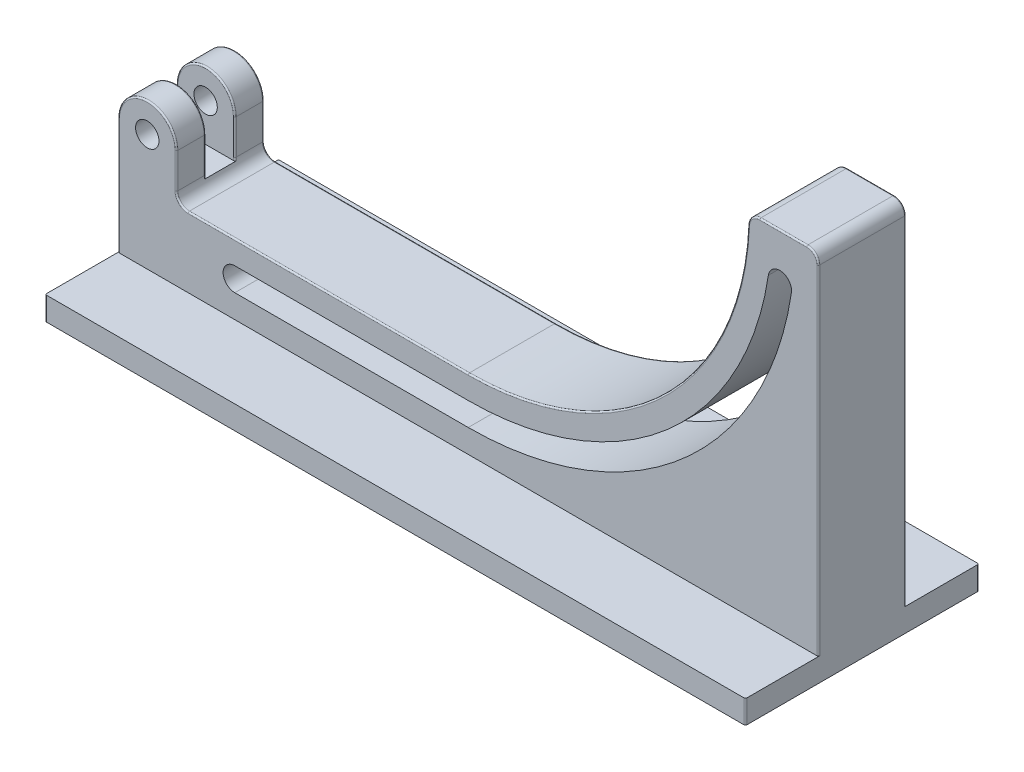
ISO-10303-21;
HEADER;
FILE_DESCRIPTION(('STEP AP214'),'2;1');
FILE_NAME('part.step','',(''),(''),'','','');
FILE_SCHEMA(('AUTOMOTIVE_DESIGN { 1 0 10303 214 1 1 1 1 }'));
ENDSEC;
DATA;
#1=APPLICATION_CONTEXT('core data for automotive mechanical design processes');
#2=APPLICATION_PROTOCOL_DEFINITION('international standard','automotive_design',2000,#1);
#3=PRODUCT_CONTEXT('',#1,'mechanical');
#4=PRODUCT('Part','Part','',(#3));
#5=PRODUCT_RELATED_PRODUCT_CATEGORY('part','',(#4));
#6=PRODUCT_DEFINITION_FORMATION('','',#4);
#7=PRODUCT_DEFINITION_CONTEXT('part definition',#1,'design');
#8=PRODUCT_DEFINITION('design','',#6,#7);
#9=PRODUCT_DEFINITION_SHAPE('','',#8);
#10=(LENGTH_UNIT() NAMED_UNIT(*) SI_UNIT(.MILLI.,.METRE.));
#11=(NAMED_UNIT(*) PLANE_ANGLE_UNIT() SI_UNIT($,.RADIAN.));
#12=(NAMED_UNIT(*) SI_UNIT($,.STERADIAN.) SOLID_ANGLE_UNIT());
#13=UNCERTAINTY_MEASURE_WITH_UNIT(LENGTH_MEASURE(1.E-05),#10,'distance_accuracy_value','');
#14=(GEOMETRIC_REPRESENTATION_CONTEXT(3) GLOBAL_UNCERTAINTY_ASSIGNED_CONTEXT((#13)) GLOBAL_UNIT_ASSIGNED_CONTEXT((#10,
#11,#12)) REPRESENTATION_CONTEXT('',''));
#15=CARTESIAN_POINT('',(0.,0.,0.));
#16=DIRECTION('',(0.,0.,1.));
#17=DIRECTION('',(1.,0.,0.));
#18=AXIS2_PLACEMENT_3D('',#15,#16,#17);
#19=CARTESIAN_POINT('',(-317.5,0.,47.625));
#20=DIRECTION('',(-1.,0.,0.));
#21=DIRECTION('',(0.,0.,1.));
#22=AXIS2_PLACEMENT_3D('',#19,#20,#21);
#23=PLANE('',#22);
#24=DIRECTION('',(0.,0.,-1.));
#25=VECTOR('',#24,1.);
#26=CARTESIAN_POINT('',(-317.5,88.9,-47.625));
#27=LINE('',#26,#25);
#28=CARTESIAN_POINT('',(-317.5,88.9,46.0375));
#29=VERTEX_POINT('',#28);
#30=CARTESIAN_POINT('',(-317.5,88.9,17.4625));
#31=VERTEX_POINT('',#30);
#32=EDGE_CURVE('E475',#29,#31,#27,.T.);
#33=ORIENTED_EDGE('',*,*,#32,.T.);
#34=DIRECTION('',(0.,1.,0.));
#35=VECTOR('',#34,1.);
#36=CARTESIAN_POINT('',(-317.5,0.,17.4625));
#37=LINE('',#36,#35);
#38=CARTESIAN_POINT('',(-317.5,127.,17.4625));
#39=VERTEX_POINT('',#38);
#40=EDGE_CURVE('E834',#31,#39,#37,.T.);
#41=ORIENTED_EDGE('',*,*,#40,.T.);
#42=DIRECTION('',(0.,0.,-1.));
#43=VECTOR('',#42,1.);
#44=CARTESIAN_POINT('',(-317.5,127.,47.625));
#45=LINE('',#44,#43);
#46=CARTESIAN_POINT('',(-317.5,127.,46.0375));
#47=VERTEX_POINT('',#46);
#48=EDGE_CURVE('E512',#47,#39,#45,.T.);
#49=ORIENTED_EDGE('',*,*,#48,.F.);
#50=DIRECTION('',(0.,1.,0.));
#51=VECTOR('',#50,1.);
#52=CARTESIAN_POINT('',(-317.5,0.,46.0375));
#53=LINE('',#52,#51);
#54=EDGE_CURVE('E832',#47,#29,#53,.F.);
#55=ORIENTED_EDGE('',*,*,#54,.T.);
#56=EDGE_LOOP('',(#33,#41,#49,#55));
#57=FACE_BOUND('',#56,.T.);
#58=ADVANCED_FACE('F33',(#57),#23,.F.);
#59=CARTESIAN_POINT('',(-381.,0.,127.));
#60=DIRECTION('',(0.,1.,0.));
#61=DIRECTION('',(0.,0.,1.));
#62=AXIS2_PLACEMENT_3D('',#59,#60,#61);
#63=PLANE('',#62);
#64=DIRECTION('',(0.,0.,-1.));
#65=VECTOR('',#64,1.);
#66=CARTESIAN_POINT('',(381.,0.,-127.));
#67=LINE('',#66,#65);
#68=CARTESIAN_POINT('',(381.,0.,-46.0375));
#69=VERTEX_POINT('',#68);
#70=CARTESIAN_POINT('',(381.,0.,-125.4125));
#71=VERTEX_POINT('',#70);
#72=EDGE_CURVE('E515',#69,#71,#67,.T.);
#73=ORIENTED_EDGE('',*,*,#72,.T.);
#74=CARTESIAN_POINT('',(379.4125,0.,-125.4125));
#75=DIRECTION('',(0.,1.,0.));
#76=DIRECTION('',(0.,0.,1.));
#77=AXIS2_PLACEMENT_3D('',#74,#75,#76);
#78=CIRCLE('',#77,1.5875);
#79=CARTESIAN_POINT('',(379.4125,0.,-127.));
#80=VERTEX_POINT('',#79);
#81=EDGE_CURVE('E547',#71,#80,#78,.T.);
#82=ORIENTED_EDGE('',*,*,#81,.T.);
#83=DIRECTION('',(-1.,0.,0.));
#84=VECTOR('',#83,1.);
#85=CARTESIAN_POINT('',(-381.,0.,-127.));
#86=LINE('',#85,#84);
#87=CARTESIAN_POINT('',(-379.4125,0.,-127.));
#88=VERTEX_POINT('',#87);
#89=EDGE_CURVE('E518',#80,#88,#86,.T.);
#90=ORIENTED_EDGE('',*,*,#89,.T.);
#91=CARTESIAN_POINT('',(-379.4125,0.,-125.4125));
#92=DIRECTION('',(0.,1.,0.));
#93=DIRECTION('',(0.,0.,1.));
#94=AXIS2_PLACEMENT_3D('',#91,#92,#93);
#95=CIRCLE('',#94,1.5875);
#96=CARTESIAN_POINT('',(-381.,0.,-125.4125));
#97=VERTEX_POINT('',#96);
#98=EDGE_CURVE('E546',#88,#97,#95,.T.);
#99=ORIENTED_EDGE('',*,*,#98,.T.);
#100=DIRECTION('',(0.,0.,1.));
#101=VECTOR('',#100,1.);
#102=CARTESIAN_POINT('',(-381.,0.,-127.));
#103=LINE('',#102,#101);
#104=CARTESIAN_POINT('',(-381.,0.,-46.0375));
#105=VERTEX_POINT('',#104);
#106=EDGE_CURVE('E506',#97,#105,#103,.T.);
#107=ORIENTED_EDGE('',*,*,#106,.T.);
#108=CARTESIAN_POINT('',(-379.4125,0.,-46.0375));
#109=DIRECTION('',(0.,1.,0.));
#110=DIRECTION('',(0.,0.,1.));
#111=AXIS2_PLACEMENT_3D('',#108,#109,#110);
#112=CIRCLE('',#111,1.5875);
#113=CARTESIAN_POINT('',(-379.4125,0.,-47.625));
#114=VERTEX_POINT('',#113);
#115=EDGE_CURVE('E915',#105,#114,#112,.F.);
#116=ORIENTED_EDGE('',*,*,#115,.T.);
#117=DIRECTION('',(1.,0.,0.));
#118=VECTOR('',#117,1.);
#119=CARTESIAN_POINT('',(-381.,0.,-47.625));
#120=LINE('',#119,#118);
#121=CARTESIAN_POINT('',(379.4125,0.,-47.625));
#122=VERTEX_POINT('',#121);
#123=EDGE_CURVE('E408',#114,#122,#120,.T.);
#124=ORIENTED_EDGE('',*,*,#123,.T.);
#125=CARTESIAN_POINT('',(379.4125,0.,-46.0375));
#126=DIRECTION('',(0.,1.,0.));
#127=DIRECTION('',(0.,0.,1.));
#128=AXIS2_PLACEMENT_3D('',#125,#126,#127);
#129=CIRCLE('',#128,1.5875);
#130=EDGE_CURVE('E925',#122,#69,#129,.F.);
#131=ORIENTED_EDGE('',*,*,#130,.T.);
#132=EDGE_LOOP('',(#73,#82,#90,#99,#107,#116,#124,#131));
#133=FACE_BOUND('',#132,.T.);
#134=ADVANCED_FACE('F659',(#133),#63,.T.);
#135=CARTESIAN_POINT('',(-317.5,127.,-17.4625));
#136=VERTEX_POINT('',#135);
#137=CARTESIAN_POINT('',(-317.5,127.,-46.0375));
#138=VERTEX_POINT('',#137);
#139=EDGE_CURVE('E681',#136,#138,#45,.T.);
#140=ORIENTED_EDGE('',*,*,#139,.F.);
#141=DIRECTION('',(0.,-1.,0.));
#142=VECTOR('',#141,1.);
#143=CARTESIAN_POINT('',(-317.5,0.,-17.4625));
#144=LINE('',#143,#142);
#145=CARTESIAN_POINT('',(-317.5,88.9,-17.4625));
#146=VERTEX_POINT('',#145);
#147=EDGE_CURVE('E683',#136,#146,#144,.T.);
#148=ORIENTED_EDGE('',*,*,#147,.T.);
#149=DIRECTION('',(0.,0.,-1.));
#150=VECTOR('',#149,1.);
#151=CARTESIAN_POINT('',(-317.5,88.9,-47.625));
#152=LINE('',#151,#150);
#153=CARTESIAN_POINT('',(-317.5,88.9,-46.0375));
#154=VERTEX_POINT('',#153);
#155=EDGE_CURVE('E472',#146,#154,#152,.T.);
#156=ORIENTED_EDGE('',*,*,#155,.T.);
#157=DIRECTION('',(0.,1.,0.));
#158=VECTOR('',#157,1.);
#159=CARTESIAN_POINT('',(-317.5,127.,-46.0375));
#160=LINE('',#159,#158);
#161=EDGE_CURVE('E686',#154,#138,#160,.T.);
#162=ORIENTED_EDGE('',*,*,#161,.T.);
#163=EDGE_LOOP('',(#140,#148,#156,#162));
#164=FACE_BOUND('',#163,.T.);
#165=ADVANCED_FACE('F662',(#164),#23,.F.);
#166=CARTESIAN_POINT('',(-349.25,127.,47.625));
#167=DIRECTION('',(0.,0.,-1.));
#168=DIRECTION('',(-1.,0.,0.));
#169=AXIS2_PLACEMENT_3D('',#166,#167,#168);
#170=CYLINDRICAL_SURFACE('',#169,31.75);
#171=ORIENTED_EDGE('',*,*,#48,.T.);
#172=CARTESIAN_POINT('',(-349.25,127.,17.4625));
#173=DIRECTION('',(0.,0.,1.));
#174=DIRECTION('',(1.,0.,0.));
#175=AXIS2_PLACEMENT_3D('',#172,#173,#174);
#176=CIRCLE('',#175,31.75);
#177=CARTESIAN_POINT('',(-381.,127.,17.4625));
#178=VERTEX_POINT('',#177);
#179=EDGE_CURVE('E572',#39,#178,#176,.T.);
#180=ORIENTED_EDGE('',*,*,#179,.T.);
#181=DIRECTION('',(0.,0.,-1.));
#182=VECTOR('',#181,1.);
#183=CARTESIAN_POINT('',(-381.,127.,47.625));
#184=LINE('',#183,#182);
#185=CARTESIAN_POINT('',(-381.,127.,46.0375));
#186=VERTEX_POINT('',#185);
#187=EDGE_CURVE('E411',#186,#178,#184,.T.);
#188=ORIENTED_EDGE('',*,*,#187,.F.);
#189=CARTESIAN_POINT('',(-349.25,127.,46.0375));
#190=DIRECTION('',(0.,0.,-1.));
#191=DIRECTION('',(-1.,0.,0.));
#192=AXIS2_PLACEMENT_3D('',#189,#190,#191);
#193=CIRCLE('',#192,31.75);
#194=EDGE_CURVE('E570',#186,#47,#193,.T.);
#195=ORIENTED_EDGE('',*,*,#194,.T.);
#196=EDGE_LOOP('',(#171,#180,#188,#195));
#197=FACE_BOUND('',#196,.T.);
#198=ADVANCED_FACE('F671',(#197),#170,.T.);
#199=CARTESIAN_POINT('',(-349.25,127.,47.625));
#200=DIRECTION('',(0.,0.,-1.));
#201=DIRECTION('',(-1.,0.,0.));
#202=AXIS2_PLACEMENT_3D('',#199,#200,#201);
#203=CYLINDRICAL_SURFACE('',#202,12.7);
#204=CARTESIAN_POINT('',(-349.25,127.,15.875));
#205=DIRECTION('',(0.,0.,1.));
#206=DIRECTION('',(1.,0.,0.));
#207=AXIS2_PLACEMENT_3D('',#204,#205,#206);
#208=CIRCLE('',#207,12.7);
#209=CARTESIAN_POINT('',(-336.55,127.,15.875));
#210=VERTEX_POINT('',#209);
#211=EDGE_CURVE('E402',#210,#210,#208,.T.);
#212=ORIENTED_EDGE('',*,*,#211,.F.);
#213=EDGE_LOOP('',(#212));
#214=FACE_BOUND('',#213,.T.);
#215=CARTESIAN_POINT('',(-349.25,127.,47.625));
#216=DIRECTION('',(0.,0.,1.));
#217=DIRECTION('',(1.,0.,0.));
#218=AXIS2_PLACEMENT_3D('',#215,#216,#217);
#219=CIRCLE('',#218,12.7);
#220=CARTESIAN_POINT('',(-336.55,127.,47.625));
#221=VERTEX_POINT('',#220);
#222=EDGE_CURVE('E405',#221,#221,#219,.T.);
#223=ORIENTED_EDGE('',*,*,#222,.T.);
#224=EDGE_LOOP('',(#223));
#225=FACE_BOUND('',#224,.T.);
#226=ADVANCED_FACE('F676',(#214,#225),#203,.F.);
#227=DIRECTION('',(1.,0.,0.));
#228=VECTOR('',#227,1.);
#229=CARTESIAN_POINT('',(-381.,0.,127.));
#230=LINE('',#229,#228);
#231=CARTESIAN_POINT('',(-379.4125,0.,127.));
#232=VERTEX_POINT('',#231);
#233=CARTESIAN_POINT('',(379.4125,0.,127.));
#234=VERTEX_POINT('',#233);
#235=EDGE_CURVE('E508',#232,#234,#230,.T.);
#236=ORIENTED_EDGE('',*,*,#235,.T.);
#237=CARTESIAN_POINT('',(379.4125,0.,125.4125));
#238=DIRECTION('',(0.,1.,0.));
#239=DIRECTION('',(0.,0.,1.));
#240=AXIS2_PLACEMENT_3D('',#237,#238,#239);
#241=CIRCLE('',#240,1.5875);
#242=CARTESIAN_POINT('',(381.,0.,125.4125));
#243=VERTEX_POINT('',#242);
#244=EDGE_CURVE('E48',#234,#243,#241,.T.);
#245=ORIENTED_EDGE('',*,*,#244,.T.);
#246=CARTESIAN_POINT('',(381.,0.,46.0375));
#247=VERTEX_POINT('',#246);
#248=EDGE_CURVE('E516',#243,#247,#67,.T.);
#249=ORIENTED_EDGE('',*,*,#248,.T.);
#250=CARTESIAN_POINT('',(379.4125,0.,46.0375));
#251=DIRECTION('',(0.,1.,0.));
#252=DIRECTION('',(0.,0.,1.));
#253=AXIS2_PLACEMENT_3D('',#250,#251,#252);
#254=CIRCLE('',#253,1.5875);
#255=CARTESIAN_POINT('',(379.4125,0.,47.625));
#256=VERTEX_POINT('',#255);
#257=EDGE_CURVE('E41',#247,#256,#254,.F.);
#258=ORIENTED_EDGE('',*,*,#257,.T.);
#259=DIRECTION('',(1.,0.,0.));
#260=VECTOR('',#259,1.);
#261=CARTESIAN_POINT('',(-381.,0.,47.625));
#262=LINE('',#261,#260);
#263=CARTESIAN_POINT('',(-379.4125,0.,47.625));
#264=VERTEX_POINT('',#263);
#265=EDGE_CURVE('E417',#264,#256,#262,.T.);
#266=ORIENTED_EDGE('',*,*,#265,.F.);
#267=CARTESIAN_POINT('',(-379.4125,0.,46.0375));
#268=DIRECTION('',(0.,1.,0.));
#269=DIRECTION('',(0.,0.,1.));
#270=AXIS2_PLACEMENT_3D('',#267,#268,#269);
#271=CIRCLE('',#270,1.5875);
#272=CARTESIAN_POINT('',(-381.,0.,46.0375));
#273=VERTEX_POINT('',#272);
#274=EDGE_CURVE('E11',#264,#273,#271,.F.);
#275=ORIENTED_EDGE('',*,*,#274,.T.);
#276=CARTESIAN_POINT('',(-381.,0.,125.4125));
#277=VERTEX_POINT('',#276);
#278=EDGE_CURVE('E465',#273,#277,#103,.T.);
#279=ORIENTED_EDGE('',*,*,#278,.T.);
#280=CARTESIAN_POINT('',(-379.4125,0.,125.4125));
#281=DIRECTION('',(0.,1.,0.));
#282=DIRECTION('',(0.,0.,1.));
#283=AXIS2_PLACEMENT_3D('',#280,#281,#282);
#284=CIRCLE('',#283,1.5875);
#285=EDGE_CURVE('E56',#277,#232,#284,.T.);
#286=ORIENTED_EDGE('',*,*,#285,.T.);
#287=EDGE_LOOP('',(#236,#245,#249,#258,#266,#275,#279,#286));
#288=FACE_BOUND('',#287,.T.);
#289=ADVANCED_FACE('F668',(#288),#63,.T.);
#290=CARTESIAN_POINT('',(-381.,-25.4,-127.));
#291=DIRECTION('',(-1.,0.,0.));
#292=DIRECTION('',(0.,0.,1.));
#293=AXIS2_PLACEMENT_3D('',#290,#291,#292);
#294=PLANE('',#293);
#295=DIRECTION('',(0.,0.,1.));
#296=VECTOR('',#295,1.);
#297=CARTESIAN_POINT('',(-381.,85.725,-127.));
#298=LINE('',#297,#296);
#299=CARTESIAN_POINT('',(-381.,85.725,-17.4625));
#300=VERTEX_POINT('',#299);
#301=CARTESIAN_POINT('',(-381.,85.725,17.4625));
#302=VERTEX_POINT('',#301);
#303=EDGE_CURVE('E399',#300,#302,#298,.T.);
#304=ORIENTED_EDGE('',*,*,#303,.F.);
#305=DIRECTION('',(0.,-1.,0.));
#306=VECTOR('',#305,1.);
#307=CARTESIAN_POINT('',(-381.,127.,-17.4625));
#308=LINE('',#307,#306);
#309=CARTESIAN_POINT('',(-381.,127.,-17.4625));
#310=VERTEX_POINT('',#309);
#311=EDGE_CURVE('E812',#300,#310,#308,.F.);
#312=ORIENTED_EDGE('',*,*,#311,.T.);
#313=CARTESIAN_POINT('',(-381.,127.,-46.0375));
#314=VERTEX_POINT('',#313);
#315=EDGE_CURVE('E460',#310,#314,#184,.T.);
#316=ORIENTED_EDGE('',*,*,#315,.T.);
#317=DIRECTION('',(0.,-1.,0.));
#318=VECTOR('',#317,1.);
#319=CARTESIAN_POINT('',(-381.,-25.4,-46.0375));
#320=LINE('',#319,#318);
#321=EDGE_CURVE('E802',#314,#105,#320,.T.);
#322=ORIENTED_EDGE('',*,*,#321,.T.);
#323=ORIENTED_EDGE('',*,*,#106,.F.);
#324=DIRECTION('',(0.,1.,0.));
#325=VECTOR('',#324,1.);
#326=CARTESIAN_POINT('',(-381.,-25.4,-125.4125));
#327=LINE('',#326,#325);
#328=CARTESIAN_POINT('',(-381.,-25.4,-125.4125));
#329=VERTEX_POINT('',#328);
#330=EDGE_CURVE('E798',#97,#329,#327,.F.);
#331=ORIENTED_EDGE('',*,*,#330,.T.);
#332=DIRECTION('',(0.,0.,1.));
#333=VECTOR('',#332,1.);
#334=CARTESIAN_POINT('',(-381.,-25.4,-127.));
#335=LINE('',#334,#333);
#336=CARTESIAN_POINT('',(-381.,-25.4,125.4125));
#337=VERTEX_POINT('',#336);
#338=EDGE_CURVE('E521',#329,#337,#335,.T.);
#339=ORIENTED_EDGE('',*,*,#338,.T.);
#340=DIRECTION('',(0.,1.,0.));
#341=VECTOR('',#340,1.);
#342=CARTESIAN_POINT('',(-381.,-25.4,125.4125));
#343=LINE('',#342,#341);
#344=EDGE_CURVE('E505',#337,#277,#343,.T.);
#345=ORIENTED_EDGE('',*,*,#344,.T.);
#346=ORIENTED_EDGE('',*,*,#278,.F.);
#347=DIRECTION('',(0.,-1.,0.));
#348=VECTOR('',#347,1.);
#349=CARTESIAN_POINT('',(-381.,127.,46.0375));
#350=LINE('',#349,#348);
#351=EDGE_CURVE('E804',#273,#186,#350,.F.);
#352=ORIENTED_EDGE('',*,*,#351,.T.);
#353=ORIENTED_EDGE('',*,*,#187,.T.);
#354=DIRECTION('',(0.,1.,0.));
#355=VECTOR('',#354,1.);
#356=CARTESIAN_POINT('',(-381.,85.725,17.4625));
#357=LINE('',#356,#355);
#358=EDGE_CURVE('E809',#178,#302,#357,.F.);
#359=ORIENTED_EDGE('',*,*,#358,.T.);
#360=EDGE_LOOP('',(#304,#312,#316,#322,#323,#331,#339,#345,#346,#352,#353,#359));
#361=FACE_BOUND('',#360,.T.);
#362=ADVANCED_FACE('F35',(#361),#294,.T.);
#363=CARTESIAN_POINT('',(-381.,-25.4,-127.));
#364=DIRECTION('',(0.,0.,-1.));
#365=DIRECTION('',(-1.,0.,0.));
#366=AXIS2_PLACEMENT_3D('',#363,#364,#365);
#367=PLANE('',#366);
#368=ORIENTED_EDGE('',*,*,#89,.F.);
#369=DIRECTION('',(0.,1.,0.));
#370=VECTOR('',#369,1.);
#371=CARTESIAN_POINT('',(379.4125,-25.4,-127.));
#372=LINE('',#371,#370);
#373=CARTESIAN_POINT('',(379.4125,-25.4,-127.));
#374=VERTEX_POINT('',#373);
#375=EDGE_CURVE('E538',#80,#374,#372,.F.);
#376=ORIENTED_EDGE('',*,*,#375,.T.);
#377=DIRECTION('',(-1.,0.,0.));
#378=VECTOR('',#377,1.);
#379=CARTESIAN_POINT('',(-381.,-25.4,-127.));
#380=LINE('',#379,#378);
#381=CARTESIAN_POINT('',(-379.4125,-25.4,-127.));
#382=VERTEX_POINT('',#381);
#383=EDGE_CURVE('E476',#374,#382,#380,.T.);
#384=ORIENTED_EDGE('',*,*,#383,.T.);
#385=DIRECTION('',(0.,1.,0.));
#386=VECTOR('',#385,1.);
#387=CARTESIAN_POINT('',(-379.4125,-25.4,-127.));
#388=LINE('',#387,#386);
#389=EDGE_CURVE('E536',#382,#88,#388,.T.);
#390=ORIENTED_EDGE('',*,*,#389,.T.);
#391=EDGE_LOOP('',(#368,#376,#384,#390));
#392=FACE_BOUND('',#391,.T.);
#393=ADVANCED_FACE('F535',(#392),#367,.T.);
#394=CARTESIAN_POINT('',(381.,-25.4,-127.));
#395=DIRECTION('',(1.,0.,0.));
#396=DIRECTION('',(0.,0.,-1.));
#397=AXIS2_PLACEMENT_3D('',#394,#395,#396);
#398=PLANE('',#397);
#399=ORIENTED_EDGE('',*,*,#72,.F.);
#400=DIRECTION('',(0.,1.,0.));
#401=VECTOR('',#400,1.);
#402=CARTESIAN_POINT('',(381.,-25.4,-46.0375));
#403=LINE('',#402,#401);
#404=CARTESIAN_POINT('',(381.,368.300000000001,-46.0375));
#405=VERTEX_POINT('',#404);
#406=EDGE_CURVE('E418',#69,#405,#403,.T.);
#407=ORIENTED_EDGE('',*,*,#406,.T.);
#408=DIRECTION('',(0.,0.,-1.));
#409=VECTOR('',#408,1.);
#410=CARTESIAN_POINT('',(381.,368.300000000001,47.625));
#411=LINE('',#410,#409);
#412=CARTESIAN_POINT('',(381.,368.300000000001,46.0375));
#413=VERTEX_POINT('',#412);
#414=EDGE_CURVE('E491',#405,#413,#411,.F.);
#415=ORIENTED_EDGE('',*,*,#414,.T.);
#416=DIRECTION('',(0.,1.,0.));
#417=VECTOR('',#416,1.);
#418=CARTESIAN_POINT('',(381.,0.,46.0375));
#419=LINE('',#418,#417);
#420=EDGE_CURVE('E775',#413,#247,#419,.F.);
#421=ORIENTED_EDGE('',*,*,#420,.T.);
#422=ORIENTED_EDGE('',*,*,#248,.F.);
#423=DIRECTION('',(0.,1.,0.));
#424=VECTOR('',#423,1.);
#425=CARTESIAN_POINT('',(381.,-25.4,125.4125));
#426=LINE('',#425,#424);
#427=CARTESIAN_POINT('',(381.,-25.4,125.4125));
#428=VERTEX_POINT('',#427);
#429=EDGE_CURVE('E836',#243,#428,#426,.F.);
#430=ORIENTED_EDGE('',*,*,#429,.T.);
#431=DIRECTION('',(0.,0.,-1.));
#432=VECTOR('',#431,1.);
#433=CARTESIAN_POINT('',(381.,-25.4,-127.));
#434=LINE('',#433,#432);
#435=CARTESIAN_POINT('',(381.,-25.4,-125.4125));
#436=VERTEX_POINT('',#435);
#437=EDGE_CURVE('E527',#428,#436,#434,.T.);
#438=ORIENTED_EDGE('',*,*,#437,.T.);
#439=DIRECTION('',(0.,1.,0.));
#440=VECTOR('',#439,1.);
#441=CARTESIAN_POINT('',(381.,-25.4,-125.4125));
#442=LINE('',#441,#440);
#443=EDGE_CURVE('E838',#436,#71,#442,.T.);
#444=ORIENTED_EDGE('',*,*,#443,.T.);
#445=EDGE_LOOP('',(#399,#407,#415,#421,#422,#430,#438,#444));
#446=FACE_BOUND('',#445,.T.);
#447=ADVANCED_FACE('F845',(#446),#398,.T.);
#448=CARTESIAN_POINT('',(-381.,-25.4,127.));
#449=DIRECTION('',(0.,0.,1.));
#450=DIRECTION('',(1.,0.,0.));
#451=AXIS2_PLACEMENT_3D('',#448,#449,#450);
#452=PLANE('',#451);
#453=DIRECTION('',(1.,0.,0.));
#454=VECTOR('',#453,1.);
#455=CARTESIAN_POINT('',(-381.,-25.4,127.));
#456=LINE('',#455,#454);
#457=CARTESIAN_POINT('',(-379.4125,-25.4,127.));
#458=VERTEX_POINT('',#457);
#459=CARTESIAN_POINT('',(379.4125,-25.4,127.));
#460=VERTEX_POINT('',#459);
#461=EDGE_CURVE('E524',#458,#460,#456,.T.);
#462=ORIENTED_EDGE('',*,*,#461,.T.);
#463=DIRECTION('',(0.,1.,0.));
#464=VECTOR('',#463,1.);
#465=CARTESIAN_POINT('',(379.4125,-25.4,127.));
#466=LINE('',#465,#464);
#467=EDGE_CURVE('E562',#460,#234,#466,.T.);
#468=ORIENTED_EDGE('',*,*,#467,.T.);
#469=ORIENTED_EDGE('',*,*,#235,.F.);
#470=DIRECTION('',(0.,1.,0.));
#471=VECTOR('',#470,1.);
#472=CARTESIAN_POINT('',(-379.4125,-25.4,127.));
#473=LINE('',#472,#471);
#474=EDGE_CURVE('E560',#232,#458,#473,.F.);
#475=ORIENTED_EDGE('',*,*,#474,.T.);
#476=EDGE_LOOP('',(#462,#468,#469,#475));
#477=FACE_BOUND('',#476,.T.);
#478=ADVANCED_FACE('F938',(#477),#452,.T.);
#479=CARTESIAN_POINT('',(-381.,-25.4,127.));
#480=DIRECTION('',(0.,1.,0.));
#481=DIRECTION('',(0.,0.,1.));
#482=AXIS2_PLACEMENT_3D('',#479,#480,#481);
#483=PLANE('',#482);
#484=ORIENTED_EDGE('',*,*,#383,.F.);
#485=CARTESIAN_POINT('',(379.4125,-25.4,-125.4125));
#486=DIRECTION('',(0.,1.,0.));
#487=DIRECTION('',(0.,0.,1.));
#488=AXIS2_PLACEMENT_3D('',#485,#486,#487);
#489=CIRCLE('',#488,1.5875);
#490=EDGE_CURVE('E558',#374,#436,#489,.F.);
#491=ORIENTED_EDGE('',*,*,#490,.T.);
#492=ORIENTED_EDGE('',*,*,#437,.F.);
#493=CARTESIAN_POINT('',(379.4125,-25.4,125.4125));
#494=DIRECTION('',(0.,1.,0.));
#495=DIRECTION('',(0.,0.,1.));
#496=AXIS2_PLACEMENT_3D('',#493,#494,#495);
#497=CIRCLE('',#496,1.5875);
#498=EDGE_CURVE('E555',#428,#460,#497,.F.);
#499=ORIENTED_EDGE('',*,*,#498,.T.);
#500=ORIENTED_EDGE('',*,*,#461,.F.);
#501=CARTESIAN_POINT('',(-379.4125,-25.4,125.4125));
#502=DIRECTION('',(0.,1.,0.));
#503=DIRECTION('',(0.,0.,1.));
#504=AXIS2_PLACEMENT_3D('',#501,#502,#503);
#505=CIRCLE('',#504,1.5875);
#506=EDGE_CURVE('E549',#458,#337,#505,.F.);
#507=ORIENTED_EDGE('',*,*,#506,.T.);
#508=ORIENTED_EDGE('',*,*,#338,.F.);
#509=CARTESIAN_POINT('',(-379.4125,-25.4,-125.4125));
#510=DIRECTION('',(0.,1.,0.));
#511=DIRECTION('',(0.,0.,1.));
#512=AXIS2_PLACEMENT_3D('',#509,#510,#511);
#513=CIRCLE('',#512,1.5875);
#514=EDGE_CURVE('E545',#329,#382,#513,.F.);
#515=ORIENTED_EDGE('',*,*,#514,.T.);
#516=EDGE_LOOP('',(#484,#491,#492,#499,#500,#507,#508,#515));
#517=FACE_BOUND('',#516,.T.);
#518=ADVANCED_FACE('F935',(#517),#483,.F.);
#519=CARTESIAN_POINT('',(-349.25,127.,47.625));
#520=DIRECTION('',(0.,0.,-1.));
#521=DIRECTION('',(-1.,0.,0.));
#522=AXIS2_PLACEMENT_3D('',#519,#520,#521);
#523=PLANE('',#522);
#524=CARTESIAN_POINT('',(-349.25,127.,47.625));
#525=DIRECTION('',(0.,0.,-1.));
#526=DIRECTION('',(-1.,0.,0.));
#527=AXIS2_PLACEMENT_3D('',#524,#525,#526);
#528=CIRCLE('',#527,30.1625);
#529=CARTESIAN_POINT('',(-319.0875,127.,47.625));
#530=VERTEX_POINT('',#529);
#531=CARTESIAN_POINT('',(-379.4125,127.,47.625));
#532=VERTEX_POINT('',#531);
#533=EDGE_CURVE('E788',#530,#532,#528,.F.);
#534=ORIENTED_EDGE('',*,*,#533,.T.);
#535=DIRECTION('',(0.,-1.,0.));
#536=VECTOR('',#535,1.);
#537=CARTESIAN_POINT('',(-379.4125,0.,47.625));
#538=LINE('',#537,#536);
#539=EDGE_CURVE('E790',#532,#264,#538,.T.);
#540=ORIENTED_EDGE('',*,*,#539,.T.);
#541=ORIENTED_EDGE('',*,*,#265,.T.);
#542=DIRECTION('',(0.,1.,0.));
#543=VECTOR('',#542,1.);
#544=CARTESIAN_POINT('',(379.4125,368.300000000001,47.625));
#545=LINE('',#544,#543);
#546=CARTESIAN_POINT('',(379.4125,368.300000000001,47.625));
#547=VERTEX_POINT('',#546);
#548=EDGE_CURVE('E773',#256,#547,#545,.T.);
#549=ORIENTED_EDGE('',*,*,#548,.T.);
#550=CARTESIAN_POINT('',(368.3,368.300000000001,47.625));
#551=DIRECTION('',(0.,0.,-1.));
#552=DIRECTION('',(-1.,0.,0.));
#553=AXIS2_PLACEMENT_3D('',#550,#551,#552);
#554=CIRCLE('',#553,11.1125);
#555=CARTESIAN_POINT('',(368.300000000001,379.412500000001,47.625));
#556=VERTEX_POINT('',#555);
#557=EDGE_CURVE('E778',#547,#556,#554,.F.);
#558=ORIENTED_EDGE('',*,*,#557,.T.);
#559=DIRECTION('',(-1.,0.,0.));
#560=VECTOR('',#559,1.);
#561=CARTESIAN_POINT('',(-349.24999999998,379.412500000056,47.625));
#562=LINE('',#561,#560);
#563=CARTESIAN_POINT('',(317.245898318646,379.412500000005,47.625));
#564=VERTEX_POINT('',#563);
#565=EDGE_CURVE('E456',#556,#564,#562,.T.);
#566=ORIENTED_EDGE('',*,*,#565,.T.);
#567=CARTESIAN_POINT('',(317.245898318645,368.300000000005,47.625));
#568=DIRECTION('',(0.,0.,-1.));
#569=DIRECTION('',(-1.,0.,0.));
#570=AXIS2_PLACEMENT_3D('',#567,#568,#569);
#571=CIRCLE('',#570,11.1125);
#572=CARTESIAN_POINT('',(306.142291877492,368.744500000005,47.625));
#573=VERTEX_POINT('',#572);
#574=EDGE_CURVE('E857',#564,#573,#571,.F.);
#575=ORIENTED_EDGE('',*,*,#574,.T.);
#576=CARTESIAN_POINT('',(6.0501225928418E-12,381.,47.625));
#577=DIRECTION('',(0.,0.,-1.));
#578=DIRECTION('',(-1.,0.,0.));
#579=AXIS2_PLACEMENT_3D('',#576,#577,#578);
#580=CIRCLE('',#579,306.3875);
#581=CARTESIAN_POINT('',(0.,74.6124999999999,47.625));
#582=VERTEX_POINT('',#581);
#583=EDGE_CURVE('E858',#573,#582,#580,.T.);
#584=ORIENTED_EDGE('',*,*,#583,.T.);
#585=DIRECTION('',(-1.,0.,0.));
#586=VECTOR('',#585,1.);
#587=CARTESIAN_POINT('',(-349.25,74.6125,47.625));
#588=LINE('',#587,#586);
#589=CARTESIAN_POINT('',(-304.8,74.6125,47.625));
#590=VERTEX_POINT('',#589);
#591=EDGE_CURVE('E860',#582,#590,#588,.T.);
#592=ORIENTED_EDGE('',*,*,#591,.T.);
#593=CARTESIAN_POINT('',(-304.8,88.9,47.625));
#594=DIRECTION('',(0.,0.,-1.));
#595=DIRECTION('',(-1.,0.,0.));
#596=AXIS2_PLACEMENT_3D('',#593,#594,#595);
#597=CIRCLE('',#596,14.2875);
#598=CARTESIAN_POINT('',(-319.0875,88.9,47.625));
#599=VERTEX_POINT('',#598);
#600=EDGE_CURVE('E864',#590,#599,#597,.T.);
#601=ORIENTED_EDGE('',*,*,#600,.T.);
#602=DIRECTION('',(0.,1.,0.));
#603=VECTOR('',#602,1.);
#604=CARTESIAN_POINT('',(-319.0875,127.,47.625));
#605=LINE('',#604,#603);
#606=EDGE_CURVE('E783',#599,#530,#605,.T.);
#607=ORIENTED_EDGE('',*,*,#606,.T.);
#608=EDGE_LOOP('',(#534,#540,#541,#549,#558,#566,#575,#584,#592,#601,#607));
#609=FACE_BOUND('',#608,.T.);
#610=ORIENTED_EDGE('',*,*,#222,.F.);
#611=EDGE_LOOP('',(#610));
#612=FACE_BOUND('',#611,.T.);
#613=DIRECTION('',(1.,0.,0.));
#614=VECTOR('',#613,1.);
#615=CARTESIAN_POINT('',(6.03336824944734E-12,25.4,47.625));
#616=LINE('',#615,#614);
#617=CARTESIAN_POINT('',(-254.,25.3999999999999,47.625));
#618=VERTEX_POINT('',#617);
#619=CARTESIAN_POINT('',(5.98479993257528E-12,25.4,47.625));
#620=VERTEX_POINT('',#619);
#621=EDGE_CURVE('E370',#618,#620,#616,.T.);
#622=ORIENTED_EDGE('',*,*,#621,.F.);
#623=CARTESIAN_POINT('',(-254.,38.0999999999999,47.625));
#624=DIRECTION('',(0.,0.,1.));
#625=DIRECTION('',(1.,0.,0.));
#626=AXIS2_PLACEMENT_3D('',#623,#624,#625);
#627=CIRCLE('',#626,12.7);
#628=CARTESIAN_POINT('',(-254.,50.7999999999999,47.625));
#629=VERTEX_POINT('',#628);
#630=EDGE_CURVE('E347',#629,#618,#627,.T.);
#631=ORIENTED_EDGE('',*,*,#630,.F.);
#632=DIRECTION('',(-1.,0.,0.));
#633=VECTOR('',#632,1.);
#634=CARTESIAN_POINT('',(6.02989880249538E-12,50.8,47.625));
#635=LINE('',#634,#633);
#636=CARTESIAN_POINT('',(6.02989880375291E-12,50.8,47.625));
#637=VERTEX_POINT('',#636);
#638=EDGE_CURVE('E379',#637,#629,#635,.T.);
#639=ORIENTED_EDGE('',*,*,#638,.F.);
#640=CARTESIAN_POINT('',(6.0501225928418E-12,381.,47.625));
#641=DIRECTION('',(0.,0.,-1.));
#642=DIRECTION('',(1.,0.,0.));
#643=AXIS2_PLACEMENT_3D('',#640,#641,#642);
#644=CIRCLE('',#643,330.2);
#645=CARTESIAN_POINT('',(326.556302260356,332.081481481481,47.625));
#646=VERTEX_POINT('',#645);
#647=EDGE_CURVE('E376',#646,#637,#644,.T.);
#648=ORIENTED_EDGE('',*,*,#647,.F.);
#649=CARTESIAN_POINT('',(339.116160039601,330.2,47.625));
#650=DIRECTION('',(0.,0.,1.));
#651=DIRECTION('',(-1.,0.,0.));
#652=AXIS2_PLACEMENT_3D('',#649,#650,#651);
#653=CIRCLE('',#652,12.7);
#654=CARTESIAN_POINT('',(351.676017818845,328.318518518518,47.625));
#655=VERTEX_POINT('',#654);
#656=EDGE_CURVE('E374',#655,#646,#653,.T.);
#657=ORIENTED_EDGE('',*,*,#656,.F.);
#658=CARTESIAN_POINT('',(6.0501225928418E-12,381.,47.625));
#659=DIRECTION('',(0.,0.,1.));
#660=DIRECTION('',(1.,0.,0.));
#661=AXIS2_PLACEMENT_3D('',#658,#659,#660);
#662=CIRCLE('',#661,355.6);
#663=EDGE_CURVE('E372',#620,#655,#662,.T.);
#664=ORIENTED_EDGE('',*,*,#663,.F.);
#665=EDGE_LOOP('',(#622,#631,#639,#648,#657,#664));
#666=FACE_BOUND('',#665,.T.);
#667=ADVANCED_FACE('F785',(#609,#612,#666),#523,.F.);
#668=CARTESIAN_POINT('',(-349.25,127.,-47.625));
#669=DIRECTION('',(0.,0.,-1.));
#670=DIRECTION('',(-1.,0.,0.));
#671=AXIS2_PLACEMENT_3D('',#668,#669,#670);
#672=PLANE('',#671);
#673=ORIENTED_EDGE('',*,*,#123,.F.);
#674=DIRECTION('',(0.,-1.,0.));
#675=VECTOR('',#674,1.);
#676=CARTESIAN_POINT('',(-379.4125,127.,-47.625));
#677=LINE('',#676,#675);
#678=CARTESIAN_POINT('',(-379.4125,127.,-47.625));
#679=VERTEX_POINT('',#678);
#680=EDGE_CURVE('E438',#114,#679,#677,.F.);
#681=ORIENTED_EDGE('',*,*,#680,.T.);
#682=CARTESIAN_POINT('',(-349.25,127.,-47.625));
#683=DIRECTION('',(0.,0.,-1.));
#684=DIRECTION('',(-1.,0.,0.));
#685=AXIS2_PLACEMENT_3D('',#682,#683,#684);
#686=CIRCLE('',#685,30.1625);
#687=CARTESIAN_POINT('',(-319.0875,127.,-47.625));
#688=VERTEX_POINT('',#687);
#689=EDGE_CURVE('E436',#679,#688,#686,.T.);
#690=ORIENTED_EDGE('',*,*,#689,.T.);
#691=DIRECTION('',(0.,1.,0.));
#692=VECTOR('',#691,1.);
#693=CARTESIAN_POINT('',(-319.0875,88.9,-47.625));
#694=LINE('',#693,#692);
#695=CARTESIAN_POINT('',(-319.0875,88.9,-47.625));
#696=VERTEX_POINT('',#695);
#697=EDGE_CURVE('E430',#688,#696,#694,.F.);
#698=ORIENTED_EDGE('',*,*,#697,.T.);
#699=CARTESIAN_POINT('',(-304.8,88.9,-47.625));
#700=DIRECTION('',(0.,0.,-1.));
#701=DIRECTION('',(-1.,0.,0.));
#702=AXIS2_PLACEMENT_3D('',#699,#700,#701);
#703=CIRCLE('',#702,14.2875);
#704=CARTESIAN_POINT('',(-304.8,74.6125,-47.625));
#705=VERTEX_POINT('',#704);
#706=EDGE_CURVE('E428',#696,#705,#703,.F.);
#707=ORIENTED_EDGE('',*,*,#706,.T.);
#708=DIRECTION('',(-1.,0.,0.));
#709=VECTOR('',#708,1.);
#710=CARTESIAN_POINT('',(0.,74.6124999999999,-47.625));
#711=LINE('',#710,#709);
#712=CARTESIAN_POINT('',(0.,74.6124999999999,-47.625));
#713=VERTEX_POINT('',#712);
#714=EDGE_CURVE('E426',#705,#713,#711,.F.);
#715=ORIENTED_EDGE('',*,*,#714,.T.);
#716=CARTESIAN_POINT('',(6.0501225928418E-12,381.,-47.625));
#717=DIRECTION('',(0.,0.,-1.));
#718=DIRECTION('',(-1.,0.,0.));
#719=AXIS2_PLACEMENT_3D('',#716,#717,#718);
#720=CIRCLE('',#719,306.3875);
#721=CARTESIAN_POINT('',(306.142291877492,368.744500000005,-47.625));
#722=VERTEX_POINT('',#721);
#723=EDGE_CURVE('E424',#713,#722,#720,.F.);
#724=ORIENTED_EDGE('',*,*,#723,.T.);
#725=CARTESIAN_POINT('',(317.245898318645,368.300000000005,-47.625));
#726=DIRECTION('',(0.,0.,-1.));
#727=DIRECTION('',(-1.,0.,0.));
#728=AXIS2_PLACEMENT_3D('',#725,#726,#727);
#729=CIRCLE('',#728,11.1125);
#730=CARTESIAN_POINT('',(317.245898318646,379.412500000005,-47.625));
#731=VERTEX_POINT('',#730);
#732=EDGE_CURVE('E422',#722,#731,#729,.T.);
#733=ORIENTED_EDGE('',*,*,#732,.T.);
#734=DIRECTION('',(-1.,0.,0.));
#735=VECTOR('',#734,1.);
#736=CARTESIAN_POINT('',(368.300000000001,379.412500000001,-47.625));
#737=LINE('',#736,#735);
#738=CARTESIAN_POINT('',(368.300000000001,379.412500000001,-47.625));
#739=VERTEX_POINT('',#738);
#740=EDGE_CURVE('E420',#731,#739,#737,.F.);
#741=ORIENTED_EDGE('',*,*,#740,.T.);
#742=CARTESIAN_POINT('',(368.3,368.300000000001,-47.625));
#743=DIRECTION('',(0.,0.,-1.));
#744=DIRECTION('',(-1.,0.,0.));
#745=AXIS2_PLACEMENT_3D('',#742,#743,#744);
#746=CIRCLE('',#745,11.1125);
#747=CARTESIAN_POINT('',(379.4125,368.300000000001,-47.625));
#748=VERTEX_POINT('',#747);
#749=EDGE_CURVE('E432',#739,#748,#746,.T.);
#750=ORIENTED_EDGE('',*,*,#749,.T.);
#751=DIRECTION('',(0.,1.,0.));
#752=VECTOR('',#751,1.);
#753=CARTESIAN_POINT('',(379.4125,127.,-47.625));
#754=LINE('',#753,#752);
#755=EDGE_CURVE('E434',#748,#122,#754,.F.);
#756=ORIENTED_EDGE('',*,*,#755,.T.);
#757=EDGE_LOOP('',(#673,#681,#690,#698,#707,#715,#724,#733,#741,#750,#756));
#758=FACE_BOUND('',#757,.T.);
#759=CARTESIAN_POINT('',(-349.25,127.,-47.625));
#760=DIRECTION('',(0.,0.,1.));
#761=DIRECTION('',(1.,0.,0.));
#762=AXIS2_PLACEMENT_3D('',#759,#760,#761);
#763=CIRCLE('',#762,12.7);
#764=CARTESIAN_POINT('',(-336.55,127.,-47.625));
#765=VERTEX_POINT('',#764);
#766=EDGE_CURVE('E401',#765,#765,#763,.T.);
#767=ORIENTED_EDGE('',*,*,#766,.T.);
#768=EDGE_LOOP('',(#767));
#769=FACE_BOUND('',#768,.T.);
#770=CARTESIAN_POINT('',(-254.,38.0999999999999,-47.625));
#771=DIRECTION('',(0.,0.,1.));
#772=DIRECTION('',(1.,0.,0.));
#773=AXIS2_PLACEMENT_3D('',#770,#771,#772);
#774=CIRCLE('',#773,12.7);
#775=CARTESIAN_POINT('',(-254.,50.7999999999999,-47.625));
#776=VERTEX_POINT('',#775);
#777=CARTESIAN_POINT('',(-254.,25.3999999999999,-47.625));
#778=VERTEX_POINT('',#777);
#779=EDGE_CURVE('E340',#776,#778,#774,.T.);
#780=ORIENTED_EDGE('',*,*,#779,.T.);
#781=DIRECTION('',(1.,0.,0.));
#782=VECTOR('',#781,1.);
#783=CARTESIAN_POINT('',(6.03336824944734E-12,25.4,-47.625));
#784=LINE('',#783,#782);
#785=CARTESIAN_POINT('',(5.98479993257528E-12,25.4,-47.625));
#786=VERTEX_POINT('',#785);
#787=EDGE_CURVE('E328',#778,#786,#784,.T.);
#788=ORIENTED_EDGE('',*,*,#787,.T.);
#789=CARTESIAN_POINT('',(6.0501225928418E-12,381.,-47.625));
#790=DIRECTION('',(0.,0.,1.));
#791=DIRECTION('',(1.,0.,0.));
#792=AXIS2_PLACEMENT_3D('',#789,#790,#791);
#793=CIRCLE('',#792,355.6);
#794=CARTESIAN_POINT('',(351.676017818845,328.318518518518,-47.625));
#795=VERTEX_POINT('',#794);
#796=EDGE_CURVE('E339',#786,#795,#793,.T.);
#797=ORIENTED_EDGE('',*,*,#796,.T.);
#798=CARTESIAN_POINT('',(339.116160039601,330.2,-47.625));
#799=DIRECTION('',(0.,0.,1.));
#800=DIRECTION('',(-1.,0.,0.));
#801=AXIS2_PLACEMENT_3D('',#798,#799,#800);
#802=CIRCLE('',#801,12.7);
#803=CARTESIAN_POINT('',(326.556302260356,332.081481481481,-47.625));
#804=VERTEX_POINT('',#803);
#805=EDGE_CURVE('E363',#795,#804,#802,.T.);
#806=ORIENTED_EDGE('',*,*,#805,.T.);
#807=CARTESIAN_POINT('',(6.0501225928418E-12,381.,-47.625));
#808=DIRECTION('',(0.,0.,-1.));
#809=DIRECTION('',(1.,0.,0.));
#810=AXIS2_PLACEMENT_3D('',#807,#808,#809);
#811=CIRCLE('',#810,330.2);
#812=CARTESIAN_POINT('',(6.02989880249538E-12,50.8,-47.625));
#813=VERTEX_POINT('',#812);
#814=EDGE_CURVE('E366',#804,#813,#811,.T.);
#815=ORIENTED_EDGE('',*,*,#814,.T.);
#816=DIRECTION('',(-1.,0.,0.));
#817=VECTOR('',#816,1.);
#818=CARTESIAN_POINT('',(6.02989880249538E-12,50.8,-47.625));
#819=LINE('',#818,#817);
#820=EDGE_CURVE('E354',#813,#776,#819,.T.);
#821=ORIENTED_EDGE('',*,*,#820,.T.);
#822=EDGE_LOOP('',(#780,#788,#797,#806,#815,#821));
#823=FACE_BOUND('',#822,.T.);
#824=ADVANCED_FACE('F351',(#758,#769,#823),#672,.T.);
#825=ORIENTED_EDGE('',*,*,#139,.T.);
#826=CARTESIAN_POINT('',(-349.25,127.,-46.0375));
#827=DIRECTION('',(0.,0.,-1.));
#828=DIRECTION('',(-1.,0.,0.));
#829=AXIS2_PLACEMENT_3D('',#826,#827,#828);
#830=CIRCLE('',#829,31.75);
#831=EDGE_CURVE('E568',#138,#314,#830,.F.);
#832=ORIENTED_EDGE('',*,*,#831,.T.);
#833=ORIENTED_EDGE('',*,*,#315,.F.);
#834=CARTESIAN_POINT('',(-349.25,127.,-17.4625));
#835=DIRECTION('',(0.,0.,-1.));
#836=DIRECTION('',(-1.,0.,0.));
#837=AXIS2_PLACEMENT_3D('',#834,#835,#836);
#838=CIRCLE('',#837,31.75);
#839=EDGE_CURVE('E566',#310,#136,#838,.T.);
#840=ORIENTED_EDGE('',*,*,#839,.T.);
#841=EDGE_LOOP('',(#825,#832,#833,#840));
#842=FACE_BOUND('',#841,.T.);
#843=ADVANCED_FACE('F678',(#842),#170,.T.);
#844=CARTESIAN_POINT('',(-349.25,127.,-15.875));
#845=DIRECTION('',(0.,0.,-1.));
#846=DIRECTION('',(-1.,0.,0.));
#847=AXIS2_PLACEMENT_3D('',#844,#845,#846);
#848=CIRCLE('',#847,12.7);
#849=CARTESIAN_POINT('',(-361.95,127.,-15.875));
#850=VERTEX_POINT('',#849);
#851=EDGE_CURVE('E396',#850,#850,#848,.T.);
#852=ORIENTED_EDGE('',*,*,#851,.F.);
#853=EDGE_LOOP('',(#852));
#854=FACE_BOUND('',#853,.T.);
#855=ORIENTED_EDGE('',*,*,#766,.F.);
#856=EDGE_LOOP('',(#855));
#857=FACE_BOUND('',#856,.T.);
#858=ADVANCED_FACE('F1078',(#854,#857),#203,.F.);
#859=CARTESIAN_POINT('',(-381.00005,85.725,15.875));
#860=DIRECTION('',(0.,-1.,0.));
#861=DIRECTION('',(0.,0.,-1.));
#862=AXIS2_PLACEMENT_3D('',#859,#860,#861);
#863=PLANE('',#862);
#864=ORIENTED_EDGE('',*,*,#303,.T.);
#865=CARTESIAN_POINT('',(-379.4125,85.725,17.4625));
#866=DIRECTION('',(0.,-1.,0.));
#867=DIRECTION('',(0.,0.,-1.));
#868=AXIS2_PLACEMENT_3D('',#865,#866,#867);
#869=CIRCLE('',#868,1.5875);
#870=CARTESIAN_POINT('',(-379.4125,85.725,15.875));
#871=VERTEX_POINT('',#870);
#872=EDGE_CURVE('E906',#302,#871,#869,.T.);
#873=ORIENTED_EDGE('',*,*,#872,.T.);
#874=DIRECTION('',(1.,0.,0.));
#875=VECTOR('',#874,1.);
#876=CARTESIAN_POINT('',(-381.00005,85.725,15.875));
#877=LINE('',#876,#875);
#878=CARTESIAN_POINT('',(-318.730255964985,85.725,15.875));
#879=VERTEX_POINT('',#878);
#880=EDGE_CURVE('E392',#871,#879,#877,.T.);
#881=ORIENTED_EDGE('',*,*,#880,.T.);
#882=CARTESIAN_POINT('',(-318.730255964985,85.725,15.875));
#883=CARTESIAN_POINT('',(-318.683387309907,85.725,15.8750009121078));
#884=CARTESIAN_POINT('',(-318.636541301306,85.725,15.8769742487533));
#885=CARTESIAN_POINT('',(-318.54318123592,85.725,15.884844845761));
#886=CARTESIAN_POINT('',(-318.496667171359,85.725,15.8907420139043));
#887=CARTESIAN_POINT('',(-318.358143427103,85.725,15.9142720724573));
#888=CARTESIAN_POINT('',(-318.267055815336,85.725,15.9377436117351));
#889=CARTESIAN_POINT('',(-318.090106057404,85.725,15.9996634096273));
#890=CARTESIAN_POINT('',(-318.004247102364,85.725,16.0381207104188));
#891=CARTESIAN_POINT('',(-317.840295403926,85.725,16.1290281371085));
#892=CARTESIAN_POINT('',(-317.762200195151,85.725,16.1814738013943));
#893=CARTESIAN_POINT('',(-317.616858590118,85.725,16.2984361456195));
#894=CARTESIAN_POINT('',(-317.549516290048,85.725,16.3628335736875));
#895=CARTESIAN_POINT('',(-317.426940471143,85.725,16.5023134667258));
#896=CARTESIAN_POINT('',(-317.371708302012,85.725,16.5773971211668));
#897=CARTESIAN_POINT('',(-317.27653933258,85.725,16.7339886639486));
#898=CARTESIAN_POINT('',(-317.236237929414,85.725,16.815275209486));
#899=CARTESIAN_POINT('',(-317.170350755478,85.725,16.9835689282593));
#900=CARTESIAN_POINT('',(-317.144749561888,85.725,17.07056999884));
#901=CARTESIAN_POINT('',(-317.116900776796,85.725,17.2090181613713));
#902=CARTESIAN_POINT('',(-317.109338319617,85.725,17.2594521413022));
#903=CARTESIAN_POINT('',(-317.099250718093,85.725,17.3607489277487));
#904=CARTESIAN_POINT('',(-317.096718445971,85.725,17.411611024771));
#905=CARTESIAN_POINT('',(-317.096722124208,85.725,17.4625));
#906=B_SPLINE_CURVE_WITH_KNOTS('',3,(#882,#883,#884,#885,#886,#887,#888,#889,#890,#891,#892,
#893,#894,#895,#896,#897,#898,#899,#900,#901,#902,#903,#904,#905),.UNSPECIFIED.,.F.,.F.,(4,2,2,
2,2,2,2,2,2,2,2,4),(0.,0.140519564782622,0.281035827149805,0.561782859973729,0.842699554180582,
1.12352675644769,1.4016894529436,1.67988313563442,1.95074823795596,2.22132863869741,
2.37409667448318,2.52664808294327),.UNSPECIFIED.);
#907=CARTESIAN_POINT('',(-317.096722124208,85.725,17.4625));
#908=VERTEX_POINT('',#907);
#909=EDGE_CURVE('E588',#879,#908,#906,.T.);
#910=ORIENTED_EDGE('',*,*,#909,.T.);
#911=DIRECTION('',(0.,0.,1.));
#912=VECTOR('',#911,1.);
#913=CARTESIAN_POINT('',(-317.096722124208,85.725,15.875));
#914=LINE('',#913,#912);
#915=CARTESIAN_POINT('',(-317.096722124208,85.725,-17.4625));
#916=VERTEX_POINT('',#915);
#917=EDGE_CURVE('E494',#908,#916,#914,.F.);
#918=ORIENTED_EDGE('',*,*,#917,.T.);
#919=CARTESIAN_POINT('',(-317.096722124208,85.725,-17.4625));
#920=CARTESIAN_POINT('',(-317.096721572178,85.725,-17.4188257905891));
#921=CARTESIAN_POINT('',(-317.098584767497,85.725,-17.3751729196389));
#922=CARTESIAN_POINT('',(-317.106012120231,85.725,-17.2881883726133));
#923=CARTESIAN_POINT('',(-317.111575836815,85.725,-17.2448566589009));
#924=CARTESIAN_POINT('',(-317.133740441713,85.725,-17.1159674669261));
#925=CARTESIAN_POINT('',(-317.15581510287,85.725,-17.0312876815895));
#926=CARTESIAN_POINT('',(-317.213822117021,85.725,-16.8668616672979));
#927=CARTESIAN_POINT('',(-317.249756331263,85.725,-16.7871161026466));
#928=CARTESIAN_POINT('',(-317.33431501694,85.725,-16.6346545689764));
#929=CARTESIAN_POINT('',(-317.382940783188,85.725,-16.5619393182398));
#930=CARTESIAN_POINT('',(-317.492181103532,85.725,-16.424410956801));
#931=CARTESIAN_POINT('',(-317.552961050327,85.725,-16.3597294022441));
#932=CARTESIAN_POINT('',(-317.684249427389,85.725,-16.2411207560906));
#933=CARTESIAN_POINT('',(-317.754760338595,85.725,-16.1871964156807));
#934=CARTESIAN_POINT('',(-317.905726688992,85.725,-16.0899729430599));
#935=CARTESIAN_POINT('',(-317.986414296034,85.725,-16.0470345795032));
#936=CARTESIAN_POINT('',(-318.153726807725,85.725,-15.9749673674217));
#937=CARTESIAN_POINT('',(-318.240350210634,85.725,-15.945835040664));
#938=CARTESIAN_POINT('',(-318.394385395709,85.725,-15.9077017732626));
#939=CARTESIAN_POINT('',(-318.46101285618,85.725,-15.8954511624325));
#940=CARTESIAN_POINT('',(-318.595171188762,85.725,-15.8790996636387));
#941=CARTESIAN_POINT('',(-318.662700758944,85.725,-15.8749880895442));
#942=CARTESIAN_POINT('',(-318.730255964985,85.725,-15.875));
#943=B_SPLINE_CURVE_WITH_KNOTS('',3,(#919,#920,#921,#922,#923,#924,#925,#926,#927,#928,#929,
#930,#931,#932,#933,#934,#935,#936,#937,#938,#939,#940,#941,#942),.UNSPECIFIED.,.F.,.F.,(4,2,2,
2,2,2,2,2,2,2,2,4),(0.,0.130940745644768,0.261865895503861,0.523040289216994,0.784249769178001,
1.04548590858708,1.31055393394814,1.57568966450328,1.84865452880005,2.1215505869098,
2.3243089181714,2.52680086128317),.UNSPECIFIED.);
#944=CARTESIAN_POINT('',(-318.730255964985,85.725,-15.875));
#945=VERTEX_POINT('',#944);
#946=EDGE_CURVE('E581',#916,#945,#943,.T.);
#947=ORIENTED_EDGE('',*,*,#946,.T.);
#948=DIRECTION('',(1.,0.,0.));
#949=VECTOR('',#948,1.);
#950=CARTESIAN_POINT('',(-381.00005,85.725,-15.875));
#951=LINE('',#950,#949);
#952=CARTESIAN_POINT('',(-379.4125,85.725,-15.875));
#953=VERTEX_POINT('',#952);
#954=EDGE_CURVE('E393',#953,#945,#951,.T.);
#955=ORIENTED_EDGE('',*,*,#954,.F.);
#956=CARTESIAN_POINT('',(-379.4125,85.725,-17.4625));
#957=DIRECTION('',(0.,-1.,0.));
#958=DIRECTION('',(0.,0.,-1.));
#959=AXIS2_PLACEMENT_3D('',#956,#957,#958);
#960=CIRCLE('',#959,1.5875);
#961=EDGE_CURVE('E578',#953,#300,#960,.T.);
#962=ORIENTED_EDGE('',*,*,#961,.T.);
#963=EDGE_LOOP('',(#864,#873,#881,#910,#918,#947,#955,#962));
#964=FACE_BOUND('',#963,.T.);
#965=ADVANCED_FACE('F594',(#964),#863,.F.);
#966=CARTESIAN_POINT('',(-381.00005,85.725,15.875));
#967=DIRECTION('',(0.,0.,1.));
#968=DIRECTION('',(1.,0.,0.));
#969=AXIS2_PLACEMENT_3D('',#966,#967,#968);
#970=PLANE('',#969);
#971=DIRECTION('',(0.,1.,0.));
#972=VECTOR('',#971,1.);
#973=CARTESIAN_POINT('',(-319.0875,85.725,15.875));
#974=LINE('',#973,#972);
#975=CARTESIAN_POINT('',(-319.0875,127.,15.875));
#976=VERTEX_POINT('',#975);
#977=CARTESIAN_POINT('',(-319.0875,88.9,15.875));
#978=VERTEX_POINT('',#977);
#979=EDGE_CURVE('E827',#976,#978,#974,.F.);
#980=ORIENTED_EDGE('',*,*,#979,.T.);
#981=CARTESIAN_POINT('',(-304.8,88.9,15.875));
#982=DIRECTION('',(0.,0.,1.));
#983=DIRECTION('',(1.,0.,0.));
#984=AXIS2_PLACEMENT_3D('',#981,#982,#983);
#985=CIRCLE('',#984,14.2875);
#986=EDGE_CURVE('E829',#978,#879,#985,.T.);
#987=ORIENTED_EDGE('',*,*,#986,.T.);
#988=ORIENTED_EDGE('',*,*,#880,.F.);
#989=DIRECTION('',(0.,1.,0.));
#990=VECTOR('',#989,1.);
#991=CARTESIAN_POINT('',(-379.4125,127.,15.875));
#992=LINE('',#991,#990);
#993=CARTESIAN_POINT('',(-379.4125,127.,15.875));
#994=VERTEX_POINT('',#993);
#995=EDGE_CURVE('E825',#871,#994,#992,.T.);
#996=ORIENTED_EDGE('',*,*,#995,.T.);
#997=CARTESIAN_POINT('',(-349.25,127.,15.875));
#998=DIRECTION('',(0.,0.,1.));
#999=DIRECTION('',(1.,0.,0.));
#1000=AXIS2_PLACEMENT_3D('',#997,#998,#999);
#1001=CIRCLE('',#1000,30.1625);
#1002=EDGE_CURVE('E695',#994,#976,#1001,.F.);
#1003=ORIENTED_EDGE('',*,*,#1002,.T.);
#1004=EDGE_LOOP('',(#980,#987,#988,#996,#1003));
#1005=FACE_BOUND('',#1004,.T.);
#1006=ORIENTED_EDGE('',*,*,#211,.T.);
#1007=EDGE_LOOP('',(#1006));
#1008=FACE_BOUND('',#1007,.T.);
#1009=ADVANCED_FACE('F651',(#1005,#1008),#970,.F.);
#1010=CARTESIAN_POINT('',(-381.00005,85.725,-15.875));
#1011=DIRECTION('',(0.,0.,-1.));
#1012=DIRECTION('',(-1.,0.,0.));
#1013=AXIS2_PLACEMENT_3D('',#1010,#1011,#1012);
#1014=PLANE('',#1013);
#1015=CARTESIAN_POINT('',(-349.25,127.,-15.875));
#1016=DIRECTION('',(0.,0.,-1.));
#1017=DIRECTION('',(-1.,0.,0.));
#1018=AXIS2_PLACEMENT_3D('',#1015,#1016,#1017);
#1019=CIRCLE('',#1018,30.1625);
#1020=CARTESIAN_POINT('',(-319.0875,127.,-15.875));
#1021=VERTEX_POINT('',#1020);
#1022=CARTESIAN_POINT('',(-379.4125,127.,-15.875));
#1023=VERTEX_POINT('',#1022);
#1024=EDGE_CURVE('E496',#1021,#1023,#1019,.F.);
#1025=ORIENTED_EDGE('',*,*,#1024,.T.);
#1026=DIRECTION('',(0.,-1.,0.));
#1027=VECTOR('',#1026,1.);
#1028=CARTESIAN_POINT('',(-379.4125,85.725,-15.875));
#1029=LINE('',#1028,#1027);
#1030=EDGE_CURVE('E502',#1023,#953,#1029,.T.);
#1031=ORIENTED_EDGE('',*,*,#1030,.T.);
#1032=ORIENTED_EDGE('',*,*,#954,.T.);
#1033=CARTESIAN_POINT('',(-304.8,88.9,-15.875));
#1034=DIRECTION('',(0.,0.,-1.));
#1035=DIRECTION('',(-1.,0.,0.));
#1036=AXIS2_PLACEMENT_3D('',#1033,#1034,#1035);
#1037=CIRCLE('',#1036,14.2875);
#1038=CARTESIAN_POINT('',(-319.0875,88.9,-15.875));
#1039=VERTEX_POINT('',#1038);
#1040=EDGE_CURVE('E500',#945,#1039,#1037,.T.);
#1041=ORIENTED_EDGE('',*,*,#1040,.T.);
#1042=DIRECTION('',(0.,-1.,0.));
#1043=VECTOR('',#1042,1.);
#1044=CARTESIAN_POINT('',(-319.0875,85.725,-15.875));
#1045=LINE('',#1044,#1043);
#1046=EDGE_CURVE('E498',#1039,#1021,#1045,.F.);
#1047=ORIENTED_EDGE('',*,*,#1046,.T.);
#1048=EDGE_LOOP('',(#1025,#1031,#1032,#1041,#1047));
#1049=FACE_BOUND('',#1048,.T.);
#1050=ORIENTED_EDGE('',*,*,#851,.T.);
#1051=EDGE_LOOP('',(#1050));
#1052=FACE_BOUND('',#1051,.T.);
#1053=ADVANCED_FACE('F648',(#1049,#1052),#1014,.F.);
#1054=CARTESIAN_POINT('',(381.,381.,47.625));
#1055=DIRECTION('',(0.,-1.,0.));
#1056=DIRECTION('',(1.,0.,0.));
#1057=AXIS2_PLACEMENT_3D('',#1054,#1055,#1056);
#1058=PLANE('',#1057);
#1059=DIRECTION('',(0.,0.,-1.));
#1060=VECTOR('',#1059,1.);
#1061=CARTESIAN_POINT('',(368.300000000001,381.000000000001,-47.625));
#1062=LINE('',#1061,#1060);
#1063=CARTESIAN_POINT('',(368.300000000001,381.000000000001,46.0375));
#1064=VERTEX_POINT('',#1063);
#1065=CARTESIAN_POINT('',(368.300000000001,381.000000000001,-46.0375));
#1066=VERTEX_POINT('',#1065);
#1067=EDGE_CURVE('E485',#1064,#1066,#1062,.T.);
#1068=ORIENTED_EDGE('',*,*,#1067,.T.);
#1069=DIRECTION('',(-1.,0.,0.));
#1070=VECTOR('',#1069,1.);
#1071=CARTESIAN_POINT('',(317.245898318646,381.000000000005,-46.0375));
#1072=LINE('',#1071,#1070);
#1073=CARTESIAN_POINT('',(317.245898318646,381.000000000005,-46.0375));
#1074=VERTEX_POINT('',#1073);
#1075=EDGE_CURVE('E576',#1066,#1074,#1072,.T.);
#1076=ORIENTED_EDGE('',*,*,#1075,.T.);
#1077=DIRECTION('',(0.,0.,-1.));
#1078=VECTOR('',#1077,1.);
#1079=CARTESIAN_POINT('',(317.245898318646,381.000000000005,47.625));
#1080=LINE('',#1079,#1078);
#1081=CARTESIAN_POINT('',(317.245898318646,381.000000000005,46.0375));
#1082=VERTEX_POINT('',#1081);
#1083=EDGE_CURVE('E488',#1074,#1082,#1080,.F.);
#1084=ORIENTED_EDGE('',*,*,#1083,.T.);
#1085=DIRECTION('',(-1.,0.,0.));
#1086=VECTOR('',#1085,1.);
#1087=CARTESIAN_POINT('',(381.,381.,46.0375));
#1088=LINE('',#1087,#1086);
#1089=EDGE_CURVE('E574',#1082,#1064,#1088,.F.);
#1090=ORIENTED_EDGE('',*,*,#1089,.T.);
#1091=EDGE_LOOP('',(#1068,#1076,#1084,#1090));
#1092=FACE_BOUND('',#1091,.T.);
#1093=ADVANCED_FACE('F645',(#1092),#1058,.F.);
#1094=CARTESIAN_POINT('',(6.0501225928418E-12,381.,47.625));
#1095=DIRECTION('',(0.,0.,-1.));
#1096=DIRECTION('',(-1.,0.,0.));
#1097=AXIS2_PLACEMENT_3D('',#1094,#1095,#1096);
#1098=CYLINDRICAL_SURFACE('',#1097,304.8);
#1099=DIRECTION('',(0.,0.,-1.));
#1100=VECTOR('',#1099,1.);
#1101=CARTESIAN_POINT('',(304.556062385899,368.808000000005,47.625));
#1102=LINE('',#1101,#1100);
#1103=CARTESIAN_POINT('',(304.556062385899,368.808000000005,46.0375));
#1104=VERTEX_POINT('',#1103);
#1105=CARTESIAN_POINT('',(304.556062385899,368.808000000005,-46.0375));
#1106=VERTEX_POINT('',#1105);
#1107=EDGE_CURVE('E482',#1104,#1106,#1102,.T.);
#1108=ORIENTED_EDGE('',*,*,#1107,.T.);
#1109=CARTESIAN_POINT('',(6.0501225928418E-12,381.,-46.0375));
#1110=DIRECTION('',(0.,0.,-1.));
#1111=DIRECTION('',(-1.,0.,0.));
#1112=AXIS2_PLACEMENT_3D('',#1109,#1110,#1111);
#1113=CIRCLE('',#1112,304.8);
#1114=CARTESIAN_POINT('',(0.,76.1999999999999,-46.0375));
#1115=VERTEX_POINT('',#1114);
#1116=EDGE_CURVE('E450',#1106,#1115,#1113,.T.);
#1117=ORIENTED_EDGE('',*,*,#1116,.T.);
#1118=DIRECTION('',(0.,0.,-1.));
#1119=VECTOR('',#1118,1.);
#1120=CARTESIAN_POINT('',(0.,76.1999999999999,47.625));
#1121=LINE('',#1120,#1119);
#1122=CARTESIAN_POINT('',(0.,76.1999999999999,46.0375));
#1123=VERTEX_POINT('',#1122);
#1124=EDGE_CURVE('E348',#1123,#1115,#1121,.T.);
#1125=ORIENTED_EDGE('',*,*,#1124,.F.);
#1126=CARTESIAN_POINT('',(6.0501225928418E-12,381.,46.0375));
#1127=DIRECTION('',(0.,0.,-1.));
#1128=DIRECTION('',(-1.,0.,0.));
#1129=AXIS2_PLACEMENT_3D('',#1126,#1127,#1128);
#1130=CIRCLE('',#1129,304.8);
#1131=EDGE_CURVE('E448',#1123,#1104,#1130,.F.);
#1132=ORIENTED_EDGE('',*,*,#1131,.T.);
#1133=EDGE_LOOP('',(#1108,#1117,#1125,#1132));
#1134=FACE_BOUND('',#1133,.T.);
#1135=ADVANCED_FACE('F641',(#1134),#1098,.F.);
#1136=CARTESIAN_POINT('',(0.,76.1999999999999,47.625));
#1137=DIRECTION('',(0.,-1.,0.));
#1138=DIRECTION('',(1.,0.,0.));
#1139=AXIS2_PLACEMENT_3D('',#1136,#1137,#1138);
#1140=PLANE('',#1139);
#1141=ORIENTED_EDGE('',*,*,#1124,.T.);
#1142=DIRECTION('',(-1.,0.,0.));
#1143=VECTOR('',#1142,1.);
#1144=CARTESIAN_POINT('',(-304.8,76.2,-46.0375));
#1145=LINE('',#1144,#1143);
#1146=CARTESIAN_POINT('',(-304.8,76.2,-46.0375));
#1147=VERTEX_POINT('',#1146);
#1148=EDGE_CURVE('E446',#1115,#1147,#1145,.T.);
#1149=ORIENTED_EDGE('',*,*,#1148,.T.);
#1150=DIRECTION('',(0.,0.,-1.));
#1151=VECTOR('',#1150,1.);
#1152=CARTESIAN_POINT('',(-304.8,76.2,47.625));
#1153=LINE('',#1152,#1151);
#1154=CARTESIAN_POINT('',(-304.8,76.2,46.0375));
#1155=VERTEX_POINT('',#1154);
#1156=EDGE_CURVE('E479',#1147,#1155,#1153,.F.);
#1157=ORIENTED_EDGE('',*,*,#1156,.T.);
#1158=DIRECTION('',(-1.,0.,0.));
#1159=VECTOR('',#1158,1.);
#1160=CARTESIAN_POINT('',(0.,76.1999999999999,46.0375));
#1161=LINE('',#1160,#1159);
#1162=EDGE_CURVE('E444',#1155,#1123,#1161,.F.);
#1163=ORIENTED_EDGE('',*,*,#1162,.T.);
#1164=EDGE_LOOP('',(#1141,#1149,#1157,#1163));
#1165=FACE_BOUND('',#1164,.T.);
#1166=ADVANCED_FACE('F638',(#1165),#1140,.F.);
#1167=CARTESIAN_POINT('',(-254.,38.0999999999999,47.625));
#1168=DIRECTION('',(0.,0.,-1.));
#1169=DIRECTION('',(-1.,0.,0.));
#1170=AXIS2_PLACEMENT_3D('',#1167,#1168,#1169);
#1171=CYLINDRICAL_SURFACE('',#1170,12.7);
#1172=ORIENTED_EDGE('',*,*,#779,.F.);
#1173=DIRECTION('',(0.,0.,-1.));
#1174=VECTOR('',#1173,1.);
#1175=CARTESIAN_POINT('',(-254.,50.7999999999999,47.625));
#1176=LINE('',#1175,#1174);
#1177=EDGE_CURVE('E381',#629,#776,#1176,.T.);
#1178=ORIENTED_EDGE('',*,*,#1177,.F.);
#1179=ORIENTED_EDGE('',*,*,#630,.T.);
#1180=DIRECTION('',(0.,0.,-1.));
#1181=VECTOR('',#1180,1.);
#1182=CARTESIAN_POINT('',(-254.,25.3999999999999,47.625));
#1183=LINE('',#1182,#1181);
#1184=EDGE_CURVE('E331',#618,#778,#1183,.T.);
#1185=ORIENTED_EDGE('',*,*,#1184,.T.);
#1186=EDGE_LOOP('',(#1172,#1178,#1179,#1185));
#1187=FACE_BOUND('',#1186,.T.);
#1188=ADVANCED_FACE('F343',(#1187),#1171,.F.);
#1189=CARTESIAN_POINT('',(6.03336824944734E-12,25.4,47.625));
#1190=DIRECTION('',(0.,1.,0.));
#1191=DIRECTION('',(-1.,0.,0.));
#1192=AXIS2_PLACEMENT_3D('',#1189,#1190,#1191);
#1193=PLANE('',#1192);
#1194=ORIENTED_EDGE('',*,*,#787,.F.);
#1195=ORIENTED_EDGE('',*,*,#1184,.F.);
#1196=ORIENTED_EDGE('',*,*,#621,.T.);
#1197=DIRECTION('',(0.,0.,-1.));
#1198=VECTOR('',#1197,1.);
#1199=CARTESIAN_POINT('',(5.98479993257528E-12,25.4,47.625));
#1200=LINE('',#1199,#1198);
#1201=EDGE_CURVE('E334',#620,#786,#1200,.T.);
#1202=ORIENTED_EDGE('',*,*,#1201,.T.);
#1203=EDGE_LOOP('',(#1194,#1195,#1196,#1202));
#1204=FACE_BOUND('',#1203,.T.);
#1205=ADVANCED_FACE('F330',(#1204),#1193,.T.);
#1206=CARTESIAN_POINT('',(6.0501225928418E-12,381.,47.625));
#1207=DIRECTION('',(0.,0.,-1.));
#1208=DIRECTION('',(-1.,0.,0.));
#1209=AXIS2_PLACEMENT_3D('',#1206,#1207,#1208);
#1210=CYLINDRICAL_SURFACE('',#1209,355.6);
#1211=ORIENTED_EDGE('',*,*,#796,.F.);
#1212=ORIENTED_EDGE('',*,*,#1201,.F.);
#1213=ORIENTED_EDGE('',*,*,#663,.T.);
#1214=DIRECTION('',(0.,0.,-1.));
#1215=VECTOR('',#1214,1.);
#1216=CARTESIAN_POINT('',(351.676017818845,328.318518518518,47.625));
#1217=LINE('',#1216,#1215);
#1218=EDGE_CURVE('E387',#655,#795,#1217,.T.);
#1219=ORIENTED_EDGE('',*,*,#1218,.T.);
#1220=EDGE_LOOP('',(#1211,#1212,#1213,#1219));
#1221=FACE_BOUND('',#1220,.T.);
#1222=ADVANCED_FACE('F629',(#1221),#1210,.F.);
#1223=CARTESIAN_POINT('',(339.116160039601,330.2,47.625));
#1224=DIRECTION('',(0.,0.,-1.));
#1225=DIRECTION('',(-1.,0.,0.));
#1226=AXIS2_PLACEMENT_3D('',#1223,#1224,#1225);
#1227=CYLINDRICAL_SURFACE('',#1226,12.7);
#1228=ORIENTED_EDGE('',*,*,#805,.F.);
#1229=ORIENTED_EDGE('',*,*,#1218,.F.);
#1230=ORIENTED_EDGE('',*,*,#656,.T.);
#1231=DIRECTION('',(0.,0.,-1.));
#1232=VECTOR('',#1231,1.);
#1233=CARTESIAN_POINT('',(326.556302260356,332.081481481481,47.625));
#1234=LINE('',#1233,#1232);
#1235=EDGE_CURVE('E385',#646,#804,#1234,.T.);
#1236=ORIENTED_EDGE('',*,*,#1235,.T.);
#1237=EDGE_LOOP('',(#1228,#1229,#1230,#1236));
#1238=FACE_BOUND('',#1237,.T.);
#1239=ADVANCED_FACE('F625',(#1238),#1227,.F.);
#1240=CARTESIAN_POINT('',(6.0501225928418E-12,381.,47.625));
#1241=DIRECTION('',(0.,0.,-1.));
#1242=DIRECTION('',(-1.,0.,0.));
#1243=AXIS2_PLACEMENT_3D('',#1240,#1241,#1242);
#1244=CYLINDRICAL_SURFACE('',#1243,330.2);
#1245=ORIENTED_EDGE('',*,*,#814,.F.);
#1246=ORIENTED_EDGE('',*,*,#1235,.F.);
#1247=ORIENTED_EDGE('',*,*,#647,.T.);
#1248=DIRECTION('',(0.,0.,-1.));
#1249=VECTOR('',#1248,1.);
#1250=CARTESIAN_POINT('',(6.02989880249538E-12,50.8,47.625));
#1251=LINE('',#1250,#1249);
#1252=EDGE_CURVE('E383',#637,#813,#1251,.T.);
#1253=ORIENTED_EDGE('',*,*,#1252,.T.);
#1254=EDGE_LOOP('',(#1245,#1246,#1247,#1253));
#1255=FACE_BOUND('',#1254,.T.);
#1256=ADVANCED_FACE('F621',(#1255),#1244,.T.);
#1257=CARTESIAN_POINT('',(6.02989880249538E-12,50.8,47.625));
#1258=DIRECTION('',(0.,-1.,0.));
#1259=DIRECTION('',(1.,0.,0.));
#1260=AXIS2_PLACEMENT_3D('',#1257,#1258,#1259);
#1261=PLANE('',#1260);
#1262=ORIENTED_EDGE('',*,*,#820,.F.);
#1263=ORIENTED_EDGE('',*,*,#1252,.F.);
#1264=ORIENTED_EDGE('',*,*,#638,.T.);
#1265=ORIENTED_EDGE('',*,*,#1177,.T.);
#1266=EDGE_LOOP('',(#1262,#1263,#1264,#1265));
#1267=FACE_BOUND('',#1266,.T.);
#1268=ADVANCED_FACE('F617',(#1267),#1261,.T.);
#1269=CARTESIAN_POINT('',(-304.8,88.9,47.625));
#1270=DIRECTION('',(0.,0.,1.));
#1271=DIRECTION('',(1.,0.,0.));
#1272=AXIS2_PLACEMENT_3D('',#1269,#1270,#1271);
#1273=CYLINDRICAL_SURFACE('',#1272,12.7);
#1274=ORIENTED_EDGE('',*,*,#155,.F.);
#1275=CARTESIAN_POINT('',(-304.8,88.9,-17.4625));
#1276=DIRECTION('',(0.,0.,-1.));
#1277=DIRECTION('',(-1.,0.,0.));
#1278=AXIS2_PLACEMENT_3D('',#1275,#1276,#1277);
#1279=CIRCLE('',#1278,12.7);
#1280=EDGE_CURVE('E820',#146,#916,#1279,.F.);
#1281=ORIENTED_EDGE('',*,*,#1280,.T.);
#1282=ORIENTED_EDGE('',*,*,#917,.F.);
#1283=CARTESIAN_POINT('',(-304.8,88.9,17.4625));
#1284=DIRECTION('',(0.,0.,1.));
#1285=DIRECTION('',(1.,0.,0.));
#1286=AXIS2_PLACEMENT_3D('',#1283,#1284,#1285);
#1287=CIRCLE('',#1286,12.7);
#1288=EDGE_CURVE('E818',#908,#31,#1287,.F.);
#1289=ORIENTED_EDGE('',*,*,#1288,.T.);
#1290=ORIENTED_EDGE('',*,*,#32,.F.);
#1291=CARTESIAN_POINT('',(-304.8,88.9,46.0375));
#1292=DIRECTION('',(0.,0.,-1.));
#1293=DIRECTION('',(-1.,0.,0.));
#1294=AXIS2_PLACEMENT_3D('',#1291,#1292,#1293);
#1295=CIRCLE('',#1294,12.7);
#1296=EDGE_CURVE('E814',#29,#1155,#1295,.F.);
#1297=ORIENTED_EDGE('',*,*,#1296,.T.);
#1298=ORIENTED_EDGE('',*,*,#1156,.F.);
#1299=CARTESIAN_POINT('',(-304.8,88.9,-46.0375));
#1300=DIRECTION('',(0.,0.,-1.));
#1301=DIRECTION('',(-1.,0.,0.));
#1302=AXIS2_PLACEMENT_3D('',#1299,#1300,#1301);
#1303=CIRCLE('',#1302,12.7);
#1304=EDGE_CURVE('E816',#1147,#154,#1303,.T.);
#1305=ORIENTED_EDGE('',*,*,#1304,.T.);
#1306=EDGE_LOOP('',(#1274,#1281,#1282,#1289,#1290,#1297,#1298,#1305));
#1307=FACE_BOUND('',#1306,.T.);
#1308=ADVANCED_FACE('F613',(#1307),#1273,.F.);
#1309=CARTESIAN_POINT('',(317.245898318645,368.300000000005,47.625));
#1310=DIRECTION('',(0.,0.,-1.));
#1311=DIRECTION('',(-1.,0.,0.));
#1312=AXIS2_PLACEMENT_3D('',#1309,#1310,#1311);
#1313=CYLINDRICAL_SURFACE('',#1312,12.7);
#1314=ORIENTED_EDGE('',*,*,#1083,.F.);
#1315=CARTESIAN_POINT('',(317.245898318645,368.300000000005,-46.0375));
#1316=DIRECTION('',(0.,0.,-1.));
#1317=DIRECTION('',(-1.,0.,0.));
#1318=AXIS2_PLACEMENT_3D('',#1315,#1316,#1317);
#1319=CIRCLE('',#1318,12.7);
#1320=EDGE_CURVE('E454',#1074,#1106,#1319,.F.);
#1321=ORIENTED_EDGE('',*,*,#1320,.T.);
#1322=ORIENTED_EDGE('',*,*,#1107,.F.);
#1323=CARTESIAN_POINT('',(317.245898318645,368.300000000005,46.0375));
#1324=DIRECTION('',(0.,0.,-1.));
#1325=DIRECTION('',(-1.,0.,0.));
#1326=AXIS2_PLACEMENT_3D('',#1323,#1324,#1325);
#1327=CIRCLE('',#1326,12.7);
#1328=EDGE_CURVE('E452',#1104,#1082,#1327,.T.);
#1329=ORIENTED_EDGE('',*,*,#1328,.T.);
#1330=EDGE_LOOP('',(#1314,#1321,#1322,#1329));
#1331=FACE_BOUND('',#1330,.T.);
#1332=ADVANCED_FACE('F609',(#1331),#1313,.T.);
#1333=CARTESIAN_POINT('',(368.3,368.300000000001,47.625));
#1334=DIRECTION('',(0.,0.,1.));
#1335=DIRECTION('',(1.,0.,0.));
#1336=AXIS2_PLACEMENT_3D('',#1333,#1334,#1335);
#1337=CYLINDRICAL_SURFACE('',#1336,12.7);
#1338=ORIENTED_EDGE('',*,*,#414,.F.);
#1339=CARTESIAN_POINT('',(368.3,368.300000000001,-46.0375));
#1340=DIRECTION('',(0.,0.,-1.));
#1341=DIRECTION('',(-1.,0.,0.));
#1342=AXIS2_PLACEMENT_3D('',#1339,#1340,#1341);
#1343=CIRCLE('',#1342,12.7);
#1344=EDGE_CURVE('E442',#405,#1066,#1343,.F.);
#1345=ORIENTED_EDGE('',*,*,#1344,.T.);
#1346=ORIENTED_EDGE('',*,*,#1067,.F.);
#1347=CARTESIAN_POINT('',(368.3,368.300000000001,46.0375));
#1348=DIRECTION('',(0.,0.,-1.));
#1349=DIRECTION('',(-1.,0.,0.));
#1350=AXIS2_PLACEMENT_3D('',#1347,#1348,#1349);
#1351=CIRCLE('',#1350,12.7);
#1352=EDGE_CURVE('E440',#1064,#413,#1351,.T.);
#1353=ORIENTED_EDGE('',*,*,#1352,.T.);
#1354=EDGE_LOOP('',(#1338,#1345,#1346,#1353));
#1355=FACE_BOUND('',#1354,.T.);
#1356=ADVANCED_FACE('F604',(#1355),#1337,.T.);
#1357=CARTESIAN_POINT('',(-304.8,88.9,-17.4625));
#1358=DIRECTION('',(0.,0.,-1.));
#1359=DIRECTION('',(-1.,0.,0.));
#1360=AXIS2_PLACEMENT_3D('',#1357,#1358,#1359);
#1361=TOROIDAL_SURFACE('',#1360,14.2875,1.5875);
#1362=ORIENTED_EDGE('',*,*,#946,.F.);
#1363=ORIENTED_EDGE('',*,*,#1280,.F.);
#1364=CARTESIAN_POINT('',(-319.0875,88.9,-17.4625));
#1365=DIRECTION('',(0.,1.,0.));
#1366=DIRECTION('',(0.,0.,1.));
#1367=AXIS2_PLACEMENT_3D('',#1364,#1365,#1366);
#1368=CIRCLE('',#1367,1.5875);
#1369=EDGE_CURVE('E355',#1039,#146,#1368,.T.);
#1370=ORIENTED_EDGE('',*,*,#1369,.F.);
#1371=ORIENTED_EDGE('',*,*,#1040,.F.);
#1372=EDGE_LOOP('',(#1362,#1363,#1370,#1371));
#1373=FACE_BOUND('',#1372,.T.);
#1374=ADVANCED_FACE('F598',(#1373),#1361,.T.);
#1375=CARTESIAN_POINT('',(-319.0875,0.,-17.4625));
#1376=DIRECTION('',(0.,-1.,0.));
#1377=DIRECTION('',(0.,0.,-1.));
#1378=AXIS2_PLACEMENT_3D('',#1375,#1376,#1377);
#1379=CYLINDRICAL_SURFACE('',#1378,1.5875);
#1380=ORIENTED_EDGE('',*,*,#1369,.T.);
#1381=ORIENTED_EDGE('',*,*,#147,.F.);
#1382=CARTESIAN_POINT('',(-319.0875,127.,-17.4625));
#1383=DIRECTION('',(0.,1.,0.));
#1384=DIRECTION('',(0.,0.,1.));
#1385=AXIS2_PLACEMENT_3D('',#1382,#1383,#1384);
#1386=CIRCLE('',#1385,1.5875);
#1387=EDGE_CURVE('E358',#1021,#136,#1386,.T.);
#1388=ORIENTED_EDGE('',*,*,#1387,.F.);
#1389=ORIENTED_EDGE('',*,*,#1046,.F.);
#1390=EDGE_LOOP('',(#1380,#1381,#1388,#1389));
#1391=FACE_BOUND('',#1390,.T.);
#1392=ADVANCED_FACE('F603',(#1391),#1379,.T.);
#1393=CARTESIAN_POINT('',(-349.25,127.,-17.4625));
#1394=DIRECTION('',(0.,0.,-1.));
#1395=DIRECTION('',(-1.,0.,0.));
#1396=AXIS2_PLACEMENT_3D('',#1393,#1394,#1395);
#1397=TOROIDAL_SURFACE('',#1396,30.1625,1.5875);
#1398=ORIENTED_EDGE('',*,*,#1387,.T.);
#1399=ORIENTED_EDGE('',*,*,#839,.F.);
#1400=CARTESIAN_POINT('',(-379.4125,127.,-17.4625));
#1401=DIRECTION('',(0.,-1.,0.));
#1402=DIRECTION('',(0.,0.,-1.));
#1403=AXIS2_PLACEMENT_3D('',#1400,#1401,#1402);
#1404=CIRCLE('',#1403,1.5875);
#1405=EDGE_CURVE('E702',#1023,#310,#1404,.T.);
#1406=ORIENTED_EDGE('',*,*,#1405,.F.);
#1407=ORIENTED_EDGE('',*,*,#1024,.F.);
#1408=EDGE_LOOP('',(#1398,#1399,#1406,#1407));
#1409=FACE_BOUND('',#1408,.T.);
#1410=ADVANCED_FACE('F699',(#1409),#1397,.T.);
#1411=CARTESIAN_POINT('',(-379.4125,85.725,-17.4625));
#1412=DIRECTION('',(0.,1.,0.));
#1413=DIRECTION('',(0.,0.,1.));
#1414=AXIS2_PLACEMENT_3D('',#1411,#1412,#1413);
#1415=CYLINDRICAL_SURFACE('',#1414,1.5875);
#1416=ORIENTED_EDGE('',*,*,#1405,.T.);
#1417=ORIENTED_EDGE('',*,*,#311,.F.);
#1418=ORIENTED_EDGE('',*,*,#961,.F.);
#1419=ORIENTED_EDGE('',*,*,#1030,.F.);
#1420=EDGE_LOOP('',(#1416,#1417,#1418,#1419));
#1421=FACE_BOUND('',#1420,.T.);
#1422=ADVANCED_FACE('F995',(#1421),#1415,.T.);
#1423=CARTESIAN_POINT('',(-379.4125,85.725,17.4625));
#1424=DIRECTION('',(0.,-1.,0.));
#1425=DIRECTION('',(0.,0.,-1.));
#1426=AXIS2_PLACEMENT_3D('',#1423,#1424,#1425);
#1427=CYLINDRICAL_SURFACE('',#1426,1.5875);
#1428=ORIENTED_EDGE('',*,*,#872,.F.);
#1429=ORIENTED_EDGE('',*,*,#358,.F.);
#1430=CARTESIAN_POINT('',(-379.4125,127.,17.4625));
#1431=DIRECTION('',(0.,1.,0.));
#1432=DIRECTION('',(0.,0.,1.));
#1433=AXIS2_PLACEMENT_3D('',#1430,#1431,#1432);
#1434=CIRCLE('',#1433,1.5875);
#1435=EDGE_CURVE('E703',#994,#178,#1434,.T.);
#1436=ORIENTED_EDGE('',*,*,#1435,.F.);
#1437=ORIENTED_EDGE('',*,*,#995,.F.);
#1438=EDGE_LOOP('',(#1428,#1429,#1436,#1437));
#1439=FACE_BOUND('',#1438,.T.);
#1440=ADVANCED_FACE('F905',(#1439),#1427,.T.);
#1441=CARTESIAN_POINT('',(-349.25,127.,17.4625));
#1442=DIRECTION('',(0.,0.,1.));
#1443=DIRECTION('',(1.,0.,0.));
#1444=AXIS2_PLACEMENT_3D('',#1441,#1442,#1443);
#1445=TOROIDAL_SURFACE('',#1444,30.1625,1.5875);
#1446=ORIENTED_EDGE('',*,*,#1435,.T.);
#1447=ORIENTED_EDGE('',*,*,#179,.F.);
#1448=CARTESIAN_POINT('',(-319.0875,127.,17.4625));
#1449=DIRECTION('',(0.,-1.,0.));
#1450=DIRECTION('',(0.,0.,-1.));
#1451=AXIS2_PLACEMENT_3D('',#1448,#1449,#1450);
#1452=CIRCLE('',#1451,1.5875);
#1453=EDGE_CURVE('E708',#976,#39,#1452,.T.);
#1454=ORIENTED_EDGE('',*,*,#1453,.F.);
#1455=ORIENTED_EDGE('',*,*,#1002,.F.);
#1456=EDGE_LOOP('',(#1446,#1447,#1454,#1455));
#1457=FACE_BOUND('',#1456,.T.);
#1458=ADVANCED_FACE('F898',(#1457),#1445,.T.);
#1459=CARTESIAN_POINT('',(-319.0875,0.,17.4625));
#1460=DIRECTION('',(0.,1.,0.));
#1461=DIRECTION('',(0.,0.,1.));
#1462=AXIS2_PLACEMENT_3D('',#1459,#1460,#1461);
#1463=CYLINDRICAL_SURFACE('',#1462,1.5875);
#1464=ORIENTED_EDGE('',*,*,#1453,.T.);
#1465=ORIENTED_EDGE('',*,*,#40,.F.);
#1466=CARTESIAN_POINT('',(-319.0875,88.9,17.4625));
#1467=DIRECTION('',(0.,-1.,0.));
#1468=DIRECTION('',(0.,0.,-1.));
#1469=AXIS2_PLACEMENT_3D('',#1466,#1467,#1468);
#1470=CIRCLE('',#1469,1.5875);
#1471=EDGE_CURVE('E711',#978,#31,#1470,.T.);
#1472=ORIENTED_EDGE('',*,*,#1471,.F.);
#1473=ORIENTED_EDGE('',*,*,#979,.F.);
#1474=EDGE_LOOP('',(#1464,#1465,#1472,#1473));
#1475=FACE_BOUND('',#1474,.T.);
#1476=ADVANCED_FACE('F892',(#1475),#1463,.T.);
#1477=CARTESIAN_POINT('',(-304.8,88.9,17.4625));
#1478=DIRECTION('',(0.,0.,1.));
#1479=DIRECTION('',(1.,0.,0.));
#1480=AXIS2_PLACEMENT_3D('',#1477,#1478,#1479);
#1481=TOROIDAL_SURFACE('',#1480,14.2875,1.5875);
#1482=ORIENTED_EDGE('',*,*,#1471,.T.);
#1483=ORIENTED_EDGE('',*,*,#1288,.F.);
#1484=ORIENTED_EDGE('',*,*,#909,.F.);
#1485=ORIENTED_EDGE('',*,*,#986,.F.);
#1486=EDGE_LOOP('',(#1482,#1483,#1484,#1485));
#1487=FACE_BOUND('',#1486,.T.);
#1488=ADVANCED_FACE('F887',(#1487),#1481,.T.);
#1489=CARTESIAN_POINT('',(-379.4125,-25.4,-46.0375));
#1490=DIRECTION('',(0.,-1.,0.));
#1491=DIRECTION('',(0.,0.,-1.));
#1492=AXIS2_PLACEMENT_3D('',#1489,#1490,#1491);
#1493=CYLINDRICAL_SURFACE('',#1492,1.5875);
#1494=ORIENTED_EDGE('',*,*,#115,.F.);
#1495=ORIENTED_EDGE('',*,*,#321,.F.);
#1496=CARTESIAN_POINT('',(-379.4125,127.,-46.0375));
#1497=DIRECTION('',(0.,1.,0.));
#1498=DIRECTION('',(0.,0.,1.));
#1499=AXIS2_PLACEMENT_3D('',#1496,#1497,#1498);
#1500=CIRCLE('',#1499,1.5875);
#1501=EDGE_CURVE('E714',#679,#314,#1500,.T.);
#1502=ORIENTED_EDGE('',*,*,#1501,.F.);
#1503=ORIENTED_EDGE('',*,*,#680,.F.);
#1504=EDGE_LOOP('',(#1494,#1495,#1502,#1503));
#1505=FACE_BOUND('',#1504,.T.);
#1506=ADVANCED_FACE('F912',(#1505),#1493,.T.);
#1507=CARTESIAN_POINT('',(-349.25,127.,-46.0375));
#1508=DIRECTION('',(0.,0.,-1.));
#1509=DIRECTION('',(-1.,0.,0.));
#1510=AXIS2_PLACEMENT_3D('',#1507,#1508,#1509);
#1511=TOROIDAL_SURFACE('',#1510,30.1625,1.5875);
#1512=ORIENTED_EDGE('',*,*,#1501,.T.);
#1513=ORIENTED_EDGE('',*,*,#831,.F.);
#1514=CARTESIAN_POINT('',(-319.0875,127.,-46.0375));
#1515=DIRECTION('',(0.,-1.,0.));
#1516=DIRECTION('',(0.,0.,-1.));
#1517=AXIS2_PLACEMENT_3D('',#1514,#1515,#1516);
#1518=CIRCLE('',#1517,1.5875);
#1519=EDGE_CURVE('E717',#688,#138,#1518,.T.);
#1520=ORIENTED_EDGE('',*,*,#1519,.F.);
#1521=ORIENTED_EDGE('',*,*,#689,.F.);
#1522=EDGE_LOOP('',(#1512,#1513,#1520,#1521));
#1523=FACE_BOUND('',#1522,.T.);
#1524=ADVANCED_FACE('F917',(#1523),#1511,.T.);
#1525=CARTESIAN_POINT('',(-319.0875,0.,-46.0375));
#1526=DIRECTION('',(0.,-1.,0.));
#1527=DIRECTION('',(0.,0.,-1.));
#1528=AXIS2_PLACEMENT_3D('',#1525,#1526,#1527);
#1529=CYLINDRICAL_SURFACE('',#1528,1.5875);
#1530=ORIENTED_EDGE('',*,*,#1519,.T.);
#1531=ORIENTED_EDGE('',*,*,#161,.F.);
#1532=CARTESIAN_POINT('',(-319.0875,88.9,-46.0375));
#1533=DIRECTION('',(0.,-1.,0.));
#1534=DIRECTION('',(0.,0.,-1.));
#1535=AXIS2_PLACEMENT_3D('',#1532,#1533,#1534);
#1536=CIRCLE('',#1535,1.5875);
#1537=EDGE_CURVE('E720',#696,#154,#1536,.T.);
#1538=ORIENTED_EDGE('',*,*,#1537,.F.);
#1539=ORIENTED_EDGE('',*,*,#697,.F.);
#1540=EDGE_LOOP('',(#1530,#1531,#1538,#1539));
#1541=FACE_BOUND('',#1540,.T.);
#1542=ADVANCED_FACE('F978',(#1541),#1529,.T.);
#1543=CARTESIAN_POINT('',(-304.8,88.9,-46.0375));
#1544=DIRECTION('',(0.,0.,-1.));
#1545=DIRECTION('',(-1.,0.,0.));
#1546=AXIS2_PLACEMENT_3D('',#1543,#1544,#1545);
#1547=TOROIDAL_SURFACE('',#1546,14.2875,1.5875);
#1548=ORIENTED_EDGE('',*,*,#1537,.T.);
#1549=ORIENTED_EDGE('',*,*,#1304,.F.);
#1550=CARTESIAN_POINT('',(-304.8,74.6125,-46.0375));
#1551=DIRECTION('',(1.,0.,0.));
#1552=DIRECTION('',(0.,0.,-1.));
#1553=AXIS2_PLACEMENT_3D('',#1550,#1551,#1552);
#1554=CIRCLE('',#1553,1.5875);
#1555=EDGE_CURVE('E723',#705,#1147,#1554,.T.);
#1556=ORIENTED_EDGE('',*,*,#1555,.F.);
#1557=ORIENTED_EDGE('',*,*,#706,.F.);
#1558=EDGE_LOOP('',(#1548,#1549,#1556,#1557));
#1559=FACE_BOUND('',#1558,.T.);
#1560=ADVANCED_FACE('F974',(#1559),#1547,.T.);
#1561=CARTESIAN_POINT('',(0.,74.6124999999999,-46.0375));
#1562=DIRECTION('',(1.,0.,0.));
#1563=DIRECTION('',(0.,1.,0.));
#1564=AXIS2_PLACEMENT_3D('',#1561,#1562,#1563);
#1565=CYLINDRICAL_SURFACE('',#1564,1.5875);
#1566=ORIENTED_EDGE('',*,*,#1555,.T.);
#1567=ORIENTED_EDGE('',*,*,#1148,.F.);
#1568=CARTESIAN_POINT('',(0.,74.6124999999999,-46.0375));
#1569=DIRECTION('',(1.,0.,0.));
#1570=DIRECTION('',(0.,1.,0.));
#1571=AXIS2_PLACEMENT_3D('',#1568,#1569,#1570);
#1572=CIRCLE('',#1571,1.5875);
#1573=EDGE_CURVE('E726',#713,#1115,#1572,.T.);
#1574=ORIENTED_EDGE('',*,*,#1573,.F.);
#1575=ORIENTED_EDGE('',*,*,#714,.F.);
#1576=EDGE_LOOP('',(#1566,#1567,#1574,#1575));
#1577=FACE_BOUND('',#1576,.T.);
#1578=ADVANCED_FACE('F970',(#1577),#1565,.T.);
#1579=CARTESIAN_POINT('',(6.0501225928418E-12,381.,-46.0375));
#1580=DIRECTION('',(0.,0.,-1.));
#1581=DIRECTION('',(-1.,0.,0.));
#1582=AXIS2_PLACEMENT_3D('',#1579,#1580,#1581);
#1583=TOROIDAL_SURFACE('',#1582,306.3875,1.5875);
#1584=ORIENTED_EDGE('',*,*,#1573,.T.);
#1585=ORIENTED_EDGE('',*,*,#1116,.F.);
#1586=CARTESIAN_POINT('',(306.142291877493,368.744500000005,-46.0375));
#1587=DIRECTION('',(0.039999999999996,0.999199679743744,0.));
#1588=DIRECTION('',(-0.999199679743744,0.039999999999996,0.));
#1589=AXIS2_PLACEMENT_3D('',#1586,#1587,#1588);
#1590=CIRCLE('',#1589,1.5875);
#1591=EDGE_CURVE('E729',#722,#1106,#1590,.T.);
#1592=ORIENTED_EDGE('',*,*,#1591,.F.);
#1593=ORIENTED_EDGE('',*,*,#723,.F.);
#1594=EDGE_LOOP('',(#1584,#1585,#1592,#1593));
#1595=FACE_BOUND('',#1594,.T.);
#1596=ADVANCED_FACE('F966',(#1595),#1583,.T.);
#1597=CARTESIAN_POINT('',(317.245898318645,368.300000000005,-46.0375));
#1598=DIRECTION('',(0.,0.,-1.));
#1599=DIRECTION('',(-1.,0.,0.));
#1600=AXIS2_PLACEMENT_3D('',#1597,#1598,#1599);
#1601=TOROIDAL_SURFACE('',#1600,11.1125,1.5875);
#1602=ORIENTED_EDGE('',*,*,#1591,.T.);
#1603=ORIENTED_EDGE('',*,*,#1320,.F.);
#1604=CARTESIAN_POINT('',(317.245898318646,379.412500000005,-46.0375));
#1605=DIRECTION('',(1.,0.,0.));
#1606=DIRECTION('',(0.,1.,0.));
#1607=AXIS2_PLACEMENT_3D('',#1604,#1605,#1606);
#1608=CIRCLE('',#1607,1.5875);
#1609=EDGE_CURVE('E732',#731,#1074,#1608,.T.);
#1610=ORIENTED_EDGE('',*,*,#1609,.F.);
#1611=ORIENTED_EDGE('',*,*,#732,.F.);
#1612=EDGE_LOOP('',(#1602,#1603,#1610,#1611));
#1613=FACE_BOUND('',#1612,.T.);
#1614=ADVANCED_FACE('F962',(#1613),#1601,.T.);
#1615=CARTESIAN_POINT('',(381.,379.4125,-46.0375));
#1616=DIRECTION('',(1.,0.,0.));
#1617=DIRECTION('',(0.,1.,0.));
#1618=AXIS2_PLACEMENT_3D('',#1615,#1616,#1617);
#1619=CYLINDRICAL_SURFACE('',#1618,1.5875);
#1620=ORIENTED_EDGE('',*,*,#1609,.T.);
#1621=ORIENTED_EDGE('',*,*,#1075,.F.);
#1622=CARTESIAN_POINT('',(368.300000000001,379.412500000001,-46.0375));
#1623=DIRECTION('',(1.,0.,0.));
#1624=DIRECTION('',(0.,1.,0.));
#1625=AXIS2_PLACEMENT_3D('',#1622,#1623,#1624);
#1626=CIRCLE('',#1625,1.5875);
#1627=EDGE_CURVE('E735',#739,#1066,#1626,.T.);
#1628=ORIENTED_EDGE('',*,*,#1627,.F.);
#1629=ORIENTED_EDGE('',*,*,#740,.F.);
#1630=EDGE_LOOP('',(#1620,#1621,#1628,#1629));
#1631=FACE_BOUND('',#1630,.T.);
#1632=ADVANCED_FACE('F958',(#1631),#1619,.T.);
#1633=CARTESIAN_POINT('',(368.3,368.300000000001,-46.0375));
#1634=DIRECTION('',(0.,0.,-1.));
#1635=DIRECTION('',(-1.,0.,0.));
#1636=AXIS2_PLACEMENT_3D('',#1633,#1634,#1635);
#1637=TOROIDAL_SURFACE('',#1636,11.1125,1.5875);
#1638=ORIENTED_EDGE('',*,*,#1627,.T.);
#1639=ORIENTED_EDGE('',*,*,#1344,.F.);
#1640=CARTESIAN_POINT('',(379.4125,368.300000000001,-46.0375));
#1641=DIRECTION('',(0.,-1.,0.));
#1642=DIRECTION('',(0.,0.,-1.));
#1643=AXIS2_PLACEMENT_3D('',#1640,#1641,#1642);
#1644=CIRCLE('',#1643,1.5875);
#1645=EDGE_CURVE('E738',#748,#405,#1644,.T.);
#1646=ORIENTED_EDGE('',*,*,#1645,.F.);
#1647=ORIENTED_EDGE('',*,*,#749,.F.);
#1648=EDGE_LOOP('',(#1638,#1639,#1646,#1647));
#1649=FACE_BOUND('',#1648,.T.);
#1650=ADVANCED_FACE('F952',(#1649),#1637,.T.);
#1651=CARTESIAN_POINT('',(379.4125,-25.4,-46.0375));
#1652=DIRECTION('',(0.,1.,0.));
#1653=DIRECTION('',(0.,0.,1.));
#1654=AXIS2_PLACEMENT_3D('',#1651,#1652,#1653);
#1655=CYLINDRICAL_SURFACE('',#1654,1.5875);
#1656=ORIENTED_EDGE('',*,*,#130,.F.);
#1657=ORIENTED_EDGE('',*,*,#755,.F.);
#1658=ORIENTED_EDGE('',*,*,#1645,.T.);
#1659=ORIENTED_EDGE('',*,*,#406,.F.);
#1660=EDGE_LOOP('',(#1656,#1657,#1658,#1659));
#1661=FACE_BOUND('',#1660,.T.);
#1662=ADVANCED_FACE('F926',(#1661),#1655,.T.);
#1663=CARTESIAN_POINT('',(-379.4125,127.,46.0375));
#1664=DIRECTION('',(0.,1.,0.));
#1665=DIRECTION('',(0.,0.,1.));
#1666=AXIS2_PLACEMENT_3D('',#1663,#1664,#1665);
#1667=CYLINDRICAL_SURFACE('',#1666,1.5875);
#1668=ORIENTED_EDGE('',*,*,#274,.F.);
#1669=ORIENTED_EDGE('',*,*,#539,.F.);
#1670=CARTESIAN_POINT('',(-379.4125,127.,46.0375));
#1671=DIRECTION('',(0.,1.,0.));
#1672=DIRECTION('',(0.,0.,1.));
#1673=AXIS2_PLACEMENT_3D('',#1670,#1671,#1672);
#1674=CIRCLE('',#1673,1.5875);
#1675=EDGE_CURVE('E740',#186,#532,#1674,.T.);
#1676=ORIENTED_EDGE('',*,*,#1675,.F.);
#1677=ORIENTED_EDGE('',*,*,#351,.F.);
#1678=EDGE_LOOP('',(#1668,#1669,#1676,#1677));
#1679=FACE_BOUND('',#1678,.T.);
#1680=ADVANCED_FACE('F944',(#1679),#1667,.T.);
#1681=CARTESIAN_POINT('',(-349.25,127.,46.0375));
#1682=DIRECTION('',(0.,0.,-1.));
#1683=DIRECTION('',(-1.,0.,0.));
#1684=AXIS2_PLACEMENT_3D('',#1681,#1682,#1683);
#1685=TOROIDAL_SURFACE('',#1684,30.1625,1.5875);
#1686=ORIENTED_EDGE('',*,*,#1675,.T.);
#1687=ORIENTED_EDGE('',*,*,#533,.F.);
#1688=CARTESIAN_POINT('',(-319.0875,127.,46.0375));
#1689=DIRECTION('',(0.,-1.,0.));
#1690=DIRECTION('',(0.,0.,-1.));
#1691=AXIS2_PLACEMENT_3D('',#1688,#1689,#1690);
#1692=CIRCLE('',#1691,1.5875);
#1693=EDGE_CURVE('E743',#47,#530,#1692,.T.);
#1694=ORIENTED_EDGE('',*,*,#1693,.F.);
#1695=ORIENTED_EDGE('',*,*,#194,.F.);
#1696=EDGE_LOOP('',(#1686,#1687,#1694,#1695));
#1697=FACE_BOUND('',#1696,.T.);
#1698=ADVANCED_FACE('F873',(#1697),#1685,.T.);
#1699=CARTESIAN_POINT('',(-319.0875,127.,46.0375));
#1700=DIRECTION('',(0.,1.,0.));
#1701=DIRECTION('',(0.,0.,1.));
#1702=AXIS2_PLACEMENT_3D('',#1699,#1700,#1701);
#1703=CYLINDRICAL_SURFACE('',#1702,1.5875);
#1704=ORIENTED_EDGE('',*,*,#1693,.T.);
#1705=ORIENTED_EDGE('',*,*,#606,.F.);
#1706=CARTESIAN_POINT('',(-319.0875,88.9,46.0375));
#1707=DIRECTION('',(0.,-1.,0.));
#1708=DIRECTION('',(0.,0.,-1.));
#1709=AXIS2_PLACEMENT_3D('',#1706,#1707,#1708);
#1710=CIRCLE('',#1709,1.5875);
#1711=EDGE_CURVE('E746',#29,#599,#1710,.T.);
#1712=ORIENTED_EDGE('',*,*,#1711,.F.);
#1713=ORIENTED_EDGE('',*,*,#54,.F.);
#1714=EDGE_LOOP('',(#1704,#1705,#1712,#1713));
#1715=FACE_BOUND('',#1714,.T.);
#1716=ADVANCED_FACE('F877',(#1715),#1703,.T.);
#1717=CARTESIAN_POINT('',(-304.8,88.9,46.0375));
#1718=DIRECTION('',(0.,0.,-1.));
#1719=DIRECTION('',(-1.,0.,0.));
#1720=AXIS2_PLACEMENT_3D('',#1717,#1718,#1719);
#1721=TOROIDAL_SURFACE('',#1720,14.2875,1.5875);
#1722=ORIENTED_EDGE('',*,*,#1711,.T.);
#1723=ORIENTED_EDGE('',*,*,#600,.F.);
#1724=CARTESIAN_POINT('',(-304.8,74.6125,46.0375));
#1725=DIRECTION('',(1.,0.,0.));
#1726=DIRECTION('',(0.,0.,-1.));
#1727=AXIS2_PLACEMENT_3D('',#1724,#1725,#1726);
#1728=CIRCLE('',#1727,1.5875);
#1729=EDGE_CURVE('E749',#1155,#590,#1728,.T.);
#1730=ORIENTED_EDGE('',*,*,#1729,.F.);
#1731=ORIENTED_EDGE('',*,*,#1296,.F.);
#1732=EDGE_LOOP('',(#1722,#1723,#1730,#1731));
#1733=FACE_BOUND('',#1732,.T.);
#1734=ADVANCED_FACE('F1282',(#1733),#1721,.T.);
#1735=CARTESIAN_POINT('',(-349.25,74.6125,46.0375));
#1736=DIRECTION('',(-1.,0.,0.));
#1737=DIRECTION('',(0.,-1.,0.));
#1738=AXIS2_PLACEMENT_3D('',#1735,#1736,#1737);
#1739=CYLINDRICAL_SURFACE('',#1738,1.5875);
#1740=ORIENTED_EDGE('',*,*,#1729,.T.);
#1741=ORIENTED_EDGE('',*,*,#591,.F.);
#1742=CARTESIAN_POINT('',(0.,74.6124999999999,46.0375));
#1743=DIRECTION('',(1.,0.,0.));
#1744=DIRECTION('',(0.,1.,0.));
#1745=AXIS2_PLACEMENT_3D('',#1742,#1743,#1744);
#1746=CIRCLE('',#1745,1.5875);
#1747=EDGE_CURVE('E752',#1123,#582,#1746,.T.);
#1748=ORIENTED_EDGE('',*,*,#1747,.F.);
#1749=ORIENTED_EDGE('',*,*,#1162,.F.);
#1750=EDGE_LOOP('',(#1740,#1741,#1748,#1749));
#1751=FACE_BOUND('',#1750,.T.);
#1752=ADVANCED_FACE('F1289',(#1751),#1739,.T.);
#1753=CARTESIAN_POINT('',(6.0501225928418E-12,381.,46.0375));
#1754=DIRECTION('',(0.,0.,-1.));
#1755=DIRECTION('',(-1.,0.,0.));
#1756=AXIS2_PLACEMENT_3D('',#1753,#1754,#1755);
#1757=TOROIDAL_SURFACE('',#1756,306.3875,1.5875);
#1758=ORIENTED_EDGE('',*,*,#1747,.T.);
#1759=ORIENTED_EDGE('',*,*,#583,.F.);
#1760=CARTESIAN_POINT('',(306.142291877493,368.744500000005,46.0375));
#1761=DIRECTION('',(0.039999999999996,0.999199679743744,0.));
#1762=DIRECTION('',(-0.999199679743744,0.039999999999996,0.));
#1763=AXIS2_PLACEMENT_3D('',#1760,#1761,#1762);
#1764=CIRCLE('',#1763,1.5875);
#1765=EDGE_CURVE('E755',#1104,#573,#1764,.T.);
#1766=ORIENTED_EDGE('',*,*,#1765,.F.);
#1767=ORIENTED_EDGE('',*,*,#1131,.F.);
#1768=EDGE_LOOP('',(#1758,#1759,#1766,#1767));
#1769=FACE_BOUND('',#1768,.T.);
#1770=ADVANCED_FACE('F1298',(#1769),#1757,.T.);
#1771=CARTESIAN_POINT('',(317.245898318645,368.300000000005,46.0375));
#1772=DIRECTION('',(0.,0.,-1.));
#1773=DIRECTION('',(-1.,0.,0.));
#1774=AXIS2_PLACEMENT_3D('',#1771,#1772,#1773);
#1775=TOROIDAL_SURFACE('',#1774,11.1125,1.5875);
#1776=ORIENTED_EDGE('',*,*,#1765,.T.);
#1777=ORIENTED_EDGE('',*,*,#574,.F.);
#1778=CARTESIAN_POINT('',(317.245898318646,379.412500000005,46.0375));
#1779=DIRECTION('',(1.,0.,0.));
#1780=DIRECTION('',(0.,1.,0.));
#1781=AXIS2_PLACEMENT_3D('',#1778,#1779,#1780);
#1782=CIRCLE('',#1781,1.5875);
#1783=EDGE_CURVE('E758',#1082,#564,#1782,.T.);
#1784=ORIENTED_EDGE('',*,*,#1783,.F.);
#1785=ORIENTED_EDGE('',*,*,#1328,.F.);
#1786=EDGE_LOOP('',(#1776,#1777,#1784,#1785));
#1787=FACE_BOUND('',#1786,.T.);
#1788=ADVANCED_FACE('F1307',(#1787),#1775,.T.);
#1789=CARTESIAN_POINT('',(-349.24999999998,379.412500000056,46.0375));
#1790=DIRECTION('',(-1.,0.,0.));
#1791=DIRECTION('',(0.,-1.,0.));
#1792=AXIS2_PLACEMENT_3D('',#1789,#1790,#1791);
#1793=CYLINDRICAL_SURFACE('',#1792,1.5875);
#1794=ORIENTED_EDGE('',*,*,#1783,.T.);
#1795=ORIENTED_EDGE('',*,*,#565,.F.);
#1796=CARTESIAN_POINT('',(368.300000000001,379.412500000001,46.0375));
#1797=DIRECTION('',(1.,0.,0.));
#1798=DIRECTION('',(0.,1.,0.));
#1799=AXIS2_PLACEMENT_3D('',#1796,#1797,#1798);
#1800=CIRCLE('',#1799,1.5875);
#1801=EDGE_CURVE('E761',#1064,#556,#1800,.T.);
#1802=ORIENTED_EDGE('',*,*,#1801,.F.);
#1803=ORIENTED_EDGE('',*,*,#1089,.F.);
#1804=EDGE_LOOP('',(#1794,#1795,#1802,#1803));
#1805=FACE_BOUND('',#1804,.T.);
#1806=ADVANCED_FACE('F854',(#1805),#1793,.T.);
#1807=CARTESIAN_POINT('',(368.3,368.300000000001,46.0375));
#1808=DIRECTION('',(0.,0.,-1.));
#1809=DIRECTION('',(-1.,0.,0.));
#1810=AXIS2_PLACEMENT_3D('',#1807,#1808,#1809);
#1811=TOROIDAL_SURFACE('',#1810,11.1125,1.5875);
#1812=ORIENTED_EDGE('',*,*,#1801,.T.);
#1813=ORIENTED_EDGE('',*,*,#557,.F.);
#1814=CARTESIAN_POINT('',(379.4125,368.300000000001,46.0375));
#1815=DIRECTION('',(0.,-1.,0.));
#1816=DIRECTION('',(0.,0.,-1.));
#1817=AXIS2_PLACEMENT_3D('',#1814,#1815,#1816);
#1818=CIRCLE('',#1817,1.5875);
#1819=EDGE_CURVE('E764',#413,#547,#1818,.T.);
#1820=ORIENTED_EDGE('',*,*,#1819,.F.);
#1821=ORIENTED_EDGE('',*,*,#1352,.F.);
#1822=EDGE_LOOP('',(#1812,#1813,#1820,#1821));
#1823=FACE_BOUND('',#1822,.T.);
#1824=ADVANCED_FACE('F779',(#1823),#1811,.T.);
#1825=CARTESIAN_POINT('',(379.4125,127.,46.0375));
#1826=DIRECTION('',(0.,-1.,0.));
#1827=DIRECTION('',(0.,0.,-1.));
#1828=AXIS2_PLACEMENT_3D('',#1825,#1826,#1827);
#1829=CYLINDRICAL_SURFACE('',#1828,1.5875);
#1830=ORIENTED_EDGE('',*,*,#257,.F.);
#1831=ORIENTED_EDGE('',*,*,#420,.F.);
#1832=ORIENTED_EDGE('',*,*,#1819,.T.);
#1833=ORIENTED_EDGE('',*,*,#548,.F.);
#1834=EDGE_LOOP('',(#1830,#1831,#1832,#1833));
#1835=FACE_BOUND('',#1834,.T.);
#1836=ADVANCED_FACE('F771',(#1835),#1829,.T.);
#1837=CARTESIAN_POINT('',(379.4125,-25.4,-125.4125));
#1838=DIRECTION('',(0.,1.,0.));
#1839=DIRECTION('',(0.,0.,1.));
#1840=AXIS2_PLACEMENT_3D('',#1837,#1838,#1839);
#1841=CYLINDRICAL_SURFACE('',#1840,1.5875);
#1842=ORIENTED_EDGE('',*,*,#490,.F.);
#1843=ORIENTED_EDGE('',*,*,#375,.F.);
#1844=ORIENTED_EDGE('',*,*,#81,.F.);
#1845=ORIENTED_EDGE('',*,*,#443,.F.);
#1846=EDGE_LOOP('',(#1842,#1843,#1844,#1845));
#1847=FACE_BOUND('',#1846,.T.);
#1848=ADVANCED_FACE('F1338',(#1847),#1841,.T.);
#1849=CARTESIAN_POINT('',(-379.4125,-25.4,-125.4125));
#1850=DIRECTION('',(0.,1.,0.));
#1851=DIRECTION('',(0.,0.,1.));
#1852=AXIS2_PLACEMENT_3D('',#1849,#1850,#1851);
#1853=CYLINDRICAL_SURFACE('',#1852,1.5875);
#1854=ORIENTED_EDGE('',*,*,#514,.F.);
#1855=ORIENTED_EDGE('',*,*,#330,.F.);
#1856=ORIENTED_EDGE('',*,*,#98,.F.);
#1857=ORIENTED_EDGE('',*,*,#389,.F.);
#1858=EDGE_LOOP('',(#1854,#1855,#1856,#1857));
#1859=FACE_BOUND('',#1858,.T.);
#1860=ADVANCED_FACE('F543',(#1859),#1853,.T.);
#1861=CARTESIAN_POINT('',(379.4125,-25.4,125.4125));
#1862=DIRECTION('',(0.,1.,0.));
#1863=DIRECTION('',(0.,0.,1.));
#1864=AXIS2_PLACEMENT_3D('',#1861,#1862,#1863);
#1865=CYLINDRICAL_SURFACE('',#1864,1.5875);
#1866=ORIENTED_EDGE('',*,*,#498,.F.);
#1867=ORIENTED_EDGE('',*,*,#429,.F.);
#1868=ORIENTED_EDGE('',*,*,#244,.F.);
#1869=ORIENTED_EDGE('',*,*,#467,.F.);
#1870=EDGE_LOOP('',(#1866,#1867,#1868,#1869));
#1871=FACE_BOUND('',#1870,.T.);
#1872=ADVANCED_FACE('F933',(#1871),#1865,.T.);
#1873=CARTESIAN_POINT('',(-379.4125,-25.4,125.4125));
#1874=DIRECTION('',(0.,1.,0.));
#1875=DIRECTION('',(0.,0.,1.));
#1876=AXIS2_PLACEMENT_3D('',#1873,#1874,#1875);
#1877=CYLINDRICAL_SURFACE('',#1876,1.5875);
#1878=ORIENTED_EDGE('',*,*,#506,.F.);
#1879=ORIENTED_EDGE('',*,*,#474,.F.);
#1880=ORIENTED_EDGE('',*,*,#285,.F.);
#1881=ORIENTED_EDGE('',*,*,#344,.F.);
#1882=EDGE_LOOP('',(#1878,#1879,#1880,#1881));
#1883=FACE_BOUND('',#1882,.T.);
#1884=ADVANCED_FACE('F941',(#1883),#1877,.T.);
#1885=CLOSED_SHELL('',(#58,#134,#165,#198,#226,#289,#362,#393,#447,#478,#518,#667,#824,#843,
#858,#965,#1009,#1053,#1093,#1135,#1166,#1188,#1205,#1222,#1239,#1256,#1268,#1308,#1332,#1356,
#1374,#1392,#1410,#1422,#1440,#1458,#1476,#1488,#1506,#1524,#1542,#1560,#1578,#1596,#1614,#1632,
#1650,#1662,#1680,#1698,#1716,#1734,#1752,#1770,#1788,#1806,#1824,#1836,#1848,#1860,#1872,#1884));
#1886=MANIFOLD_SOLID_BREP('B2',#1885);
#1887=ADVANCED_BREP_SHAPE_REPRESENTATION('',(#18,#1886),#14);
#1888=SHAPE_DEFINITION_REPRESENTATION(#9,#1887);
ENDSEC;
END-ISO-10303-21;
